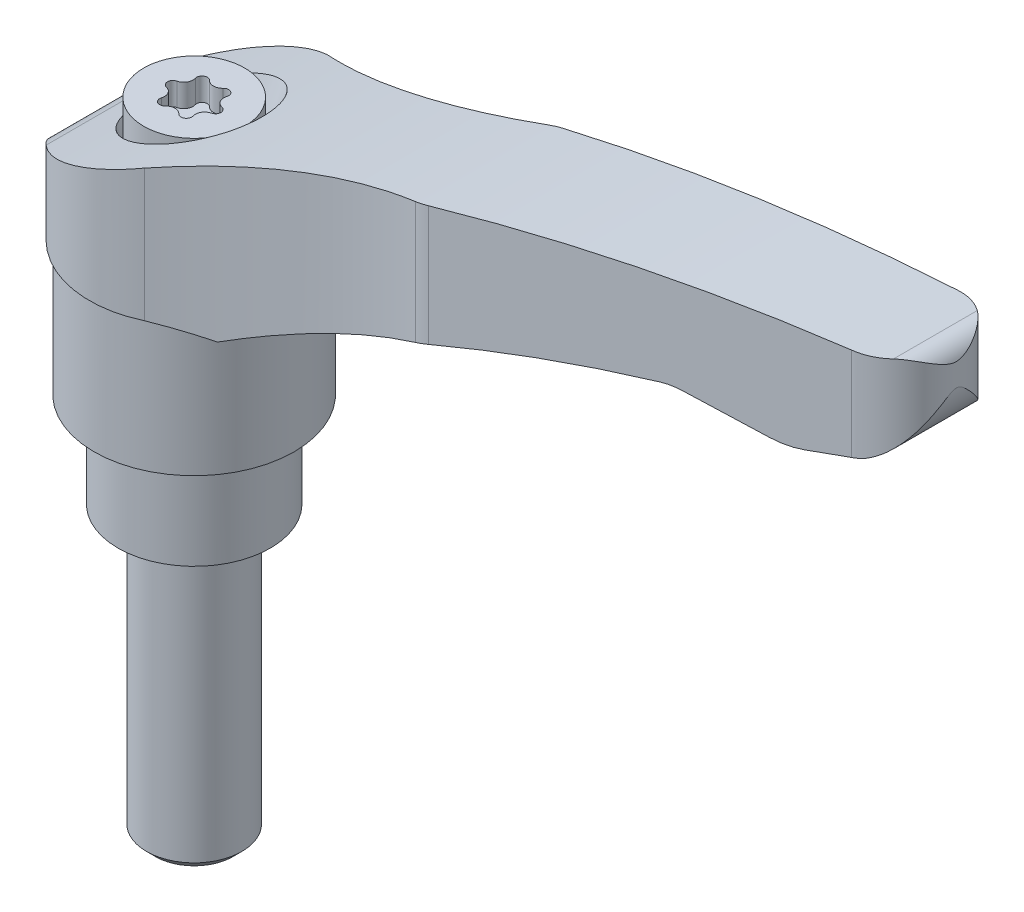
ISO-10303-21;
HEADER;
FILE_DESCRIPTION(('STEP AP214'),'2;1');
FILE_NAME('part.step','',(''),(''),'','','');
FILE_SCHEMA(('AUTOMOTIVE_DESIGN { 1 0 10303 214 1 1 1 1 }'));
ENDSEC;
DATA;
#1=APPLICATION_CONTEXT('core data for automotive mechanical design processes');
#2=APPLICATION_PROTOCOL_DEFINITION('international standard','automotive_design',2000,#1);
#3=PRODUCT_CONTEXT('',#1,'mechanical');
#4=PRODUCT('Part','Part','',(#3));
#5=PRODUCT_RELATED_PRODUCT_CATEGORY('part','',(#4));
#6=PRODUCT_DEFINITION_FORMATION('','',#4);
#7=PRODUCT_DEFINITION_CONTEXT('part definition',#1,'design');
#8=PRODUCT_DEFINITION('design','',#6,#7);
#9=PRODUCT_DEFINITION_SHAPE('','',#8);
#10=(LENGTH_UNIT() NAMED_UNIT(*) SI_UNIT(.MILLI.,.METRE.));
#11=(NAMED_UNIT(*) PLANE_ANGLE_UNIT() SI_UNIT($,.RADIAN.));
#12=(NAMED_UNIT(*) SI_UNIT($,.STERADIAN.) SOLID_ANGLE_UNIT());
#13=UNCERTAINTY_MEASURE_WITH_UNIT(LENGTH_MEASURE(1.E-05),#10,'distance_accuracy_value','');
#14=(GEOMETRIC_REPRESENTATION_CONTEXT(3) GLOBAL_UNCERTAINTY_ASSIGNED_CONTEXT((#13)) GLOBAL_UNIT_ASSIGNED_CONTEXT((#10,
#11,#12)) REPRESENTATION_CONTEXT('',''));
#15=CARTESIAN_POINT('',(0.,0.,0.));
#16=DIRECTION('',(0.,0.,1.));
#17=DIRECTION('',(1.,0.,0.));
#18=AXIS2_PLACEMENT_3D('',#15,#16,#17);
#19=CARTESIAN_POINT('',(0.,39.4,2.99687372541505));
#20=DIRECTION('',(0.,1.,0.));
#21=DIRECTION('',(0.,0.,1.));
#22=AXIS2_PLACEMENT_3D('',#19,#20,#21);
#23=CYLINDRICAL_SURFACE('',#22,0.98);
#24=DIRECTION('',(0.,1.,0.));
#25=VECTOR('',#24,1.);
#26=CARTESIAN_POINT('',(0.712727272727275,39.4,2.32425211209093));
#27=LINE('',#26,#25);
#28=CARTESIAN_POINT('',(0.712727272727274,37.,2.32425211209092));
#29=VERTEX_POINT('',#28);
#30=CARTESIAN_POINT('',(0.712727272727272,34.6,2.32425211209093));
#31=VERTEX_POINT('',#30);
#32=EDGE_CURVE('E176',#29,#31,#27,.F.);
#33=ORIENTED_EDGE('',*,*,#32,.T.);
#34=CARTESIAN_POINT('',(0.,34.6,2.99687372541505));
#35=DIRECTION('',(0.,1.,0.));
#36=DIRECTION('',(0.,0.,1.));
#37=AXIS2_PLACEMENT_3D('',#34,#35,#36);
#38=CIRCLE('',#37,0.98);
#39=CARTESIAN_POINT('',(-0.712727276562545,34.6,2.32425211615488));
#40=VERTEX_POINT('',#39);
#41=EDGE_CURVE('E165',#31,#40,#38,.T.);
#42=ORIENTED_EDGE('',*,*,#41,.T.);
#43=DIRECTION('',(0.,1.,0.));
#44=VECTOR('',#43,1.);
#45=CARTESIAN_POINT('',(-0.712727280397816,39.4,2.32425212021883));
#46=LINE('',#45,#44);
#47=CARTESIAN_POINT('',(-0.712727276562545,37.,2.32425211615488));
#48=VERTEX_POINT('',#47);
#49=EDGE_CURVE('E159',#40,#48,#46,.T.);
#50=ORIENTED_EDGE('',*,*,#49,.T.);
#51=CARTESIAN_POINT('',(0.,37.,2.99687372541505));
#52=DIRECTION('',(0.,1.,0.));
#53=DIRECTION('',(0.,0.,1.));
#54=AXIS2_PLACEMENT_3D('',#51,#52,#53);
#55=CIRCLE('',#54,0.98);
#56=EDGE_CURVE('E19',#48,#29,#55,.F.);
#57=ORIENTED_EDGE('',*,*,#56,.T.);
#58=EDGE_LOOP('',(#33,#42,#50,#57));
#59=FACE_BOUND('',#58,.T.);
#60=ADVANCED_FACE('F16',(#59),#23,.T.);
#61=CARTESIAN_POINT('',(-1.12,39.4,1.93989690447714));
#62=DIRECTION('',(0.,1.,0.));
#63=DIRECTION('',(0.,0.,1.));
#64=AXIS2_PLACEMENT_3D('',#61,#62,#63);
#65=CYLINDRICAL_SURFACE('',#64,0.56);
#66=CARTESIAN_POINT('',(-1.12,34.6,1.93989690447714));
#67=DIRECTION('',(0.,1.,0.));
#68=DIRECTION('',(0.,0.,1.));
#69=AXIS2_PLACEMENT_3D('',#66,#67,#68);
#70=CIRCLE('',#69,0.56);
#71=CARTESIAN_POINT('',(-1.65649773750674,34.6,1.77936598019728));
#72=VERTEX_POINT('',#71);
#73=EDGE_CURVE('E150',#72,#40,#70,.T.);
#74=ORIENTED_EDGE('',*,*,#73,.F.);
#75=DIRECTION('',(0.,1.,0.));
#76=VECTOR('',#75,1.);
#77=CARTESIAN_POINT('',(-1.65649773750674,39.4,1.77936598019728));
#78=LINE('',#77,#76);
#79=CARTESIAN_POINT('',(-1.65649773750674,37.,1.77936598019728));
#80=VERTEX_POINT('',#79);
#81=EDGE_CURVE('E162',#80,#72,#78,.F.);
#82=ORIENTED_EDGE('',*,*,#81,.F.);
#83=CARTESIAN_POINT('',(-1.12,37.,1.93989690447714));
#84=DIRECTION('',(0.,1.,0.));
#85=DIRECTION('',(0.,0.,1.));
#86=AXIS2_PLACEMENT_3D('',#83,#84,#85);
#87=CIRCLE('',#86,0.56);
#88=EDGE_CURVE('E155',#48,#80,#87,.F.);
#89=ORIENTED_EDGE('',*,*,#88,.F.);
#90=ORIENTED_EDGE('',*,*,#49,.F.);
#91=EDGE_LOOP('',(#74,#82,#89,#90));
#92=FACE_BOUND('',#91,.T.);
#93=ADVANCED_FACE('F157',(#92),#65,.F.);
#94=CARTESIAN_POINT('',(-2.59536877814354,39.4,1.49843686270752));
#95=DIRECTION('',(0.,1.,0.));
#96=DIRECTION('',(0.,0.,1.));
#97=AXIS2_PLACEMENT_3D('',#94,#95,#96);
#98=CYLINDRICAL_SURFACE('',#97,0.979999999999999);
#99=ORIENTED_EDGE('',*,*,#81,.T.);
#100=CARTESIAN_POINT('',(-2.59536877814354,34.6,1.49843686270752));
#101=DIRECTION('',(0.,1.,0.));
#102=DIRECTION('',(0.,0.,1.));
#103=AXIS2_PLACEMENT_3D('',#100,#101,#102);
#104=CIRCLE('',#103,0.979999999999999);
#105=CARTESIAN_POINT('',(-2.36922501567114,34.6,0.544886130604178));
#106=VERTEX_POINT('',#105);
#107=EDGE_CURVE('E373',#72,#106,#104,.T.);
#108=ORIENTED_EDGE('',*,*,#107,.T.);
#109=DIRECTION('',(0.,1.,0.));
#110=VECTOR('',#109,1.);
#111=CARTESIAN_POINT('',(-2.36922502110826,39.4,0.544886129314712));
#112=LINE('',#111,#110);
#113=CARTESIAN_POINT('',(-2.36922501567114,37.,0.544886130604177));
#114=VERTEX_POINT('',#113);
#115=EDGE_CURVE('E367',#106,#114,#112,.T.);
#116=ORIENTED_EDGE('',*,*,#115,.T.);
#117=CARTESIAN_POINT('',(-2.59536877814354,37.,1.49843686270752));
#118=DIRECTION('',(0.,1.,0.));
#119=DIRECTION('',(0.,0.,1.));
#120=AXIS2_PLACEMENT_3D('',#117,#118,#119);
#121=CIRCLE('',#120,0.979999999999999);
#122=EDGE_CURVE('E376',#114,#80,#121,.F.);
#123=ORIENTED_EDGE('',*,*,#122,.T.);
#124=EDGE_LOOP('',(#99,#108,#116,#123));
#125=FACE_BOUND('',#124,.T.);
#126=ADVANCED_FACE('F515',(#125),#98,.T.);
#127=CARTESIAN_POINT('',(1.12,39.4,1.93989690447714));
#128=DIRECTION('',(0.,1.,0.));
#129=DIRECTION('',(0.,0.,1.));
#130=AXIS2_PLACEMENT_3D('',#127,#128,#129);
#131=CYLINDRICAL_SURFACE('',#130,0.56);
#132=CARTESIAN_POINT('',(1.12,34.6,1.93989690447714));
#133=DIRECTION('',(0.,1.,0.));
#134=DIRECTION('',(0.,0.,1.));
#135=AXIS2_PLACEMENT_3D('',#132,#133,#134);
#136=CIRCLE('',#135,0.56);
#137=CARTESIAN_POINT('',(1.65649773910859,34.6,1.7793659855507));
#138=VERTEX_POINT('',#137);
#139=EDGE_CURVE('E370',#31,#138,#136,.T.);
#140=ORIENTED_EDGE('',*,*,#139,.F.);
#141=ORIENTED_EDGE('',*,*,#32,.F.);
#142=CARTESIAN_POINT('',(1.12,37.,1.93989690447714));
#143=DIRECTION('',(0.,1.,0.));
#144=DIRECTION('',(0.,0.,1.));
#145=AXIS2_PLACEMENT_3D('',#142,#143,#144);
#146=CIRCLE('',#145,0.56);
#147=CARTESIAN_POINT('',(1.65649773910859,37.,1.7793659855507));
#148=VERTEX_POINT('',#147);
#149=EDGE_CURVE('E170',#148,#29,#146,.F.);
#150=ORIENTED_EDGE('',*,*,#149,.F.);
#151=DIRECTION('',(0.,1.,0.));
#152=VECTOR('',#151,1.);
#153=CARTESIAN_POINT('',(1.65649774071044,39.4,1.77936599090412));
#154=LINE('',#153,#152);
#155=EDGE_CURVE('E364',#138,#148,#154,.T.);
#156=ORIENTED_EDGE('',*,*,#155,.F.);
#157=EDGE_LOOP('',(#140,#141,#150,#156));
#158=FACE_BOUND('',#157,.T.);
#159=ADVANCED_FACE('F379',(#158),#131,.F.);
#160=CARTESIAN_POINT('',(-2.24,39.4,0.));
#161=DIRECTION('',(0.,1.,0.));
#162=DIRECTION('',(0.,0.,1.));
#163=AXIS2_PLACEMENT_3D('',#160,#161,#162);
#164=CYLINDRICAL_SURFACE('',#163,0.56);
#165=CARTESIAN_POINT('',(-2.24,34.6,0.));
#166=DIRECTION('',(0.,1.,0.));
#167=DIRECTION('',(0.,0.,1.));
#168=AXIS2_PLACEMENT_3D('',#165,#166,#167);
#169=CIRCLE('',#168,0.56);
#170=CARTESIAN_POINT('',(-2.36922501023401,34.6,-0.544886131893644));
#171=VERTEX_POINT('',#170);
#172=EDGE_CURVE('E365',#171,#106,#169,.T.);
#173=ORIENTED_EDGE('',*,*,#172,.F.);
#174=DIRECTION('',(0.,1.,0.));
#175=VECTOR('',#174,1.);
#176=CARTESIAN_POINT('',(-2.36922501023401,39.4,-0.544886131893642));
#177=LINE('',#176,#175);
#178=CARTESIAN_POINT('',(-2.36922501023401,37.,-0.544886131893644));
#179=VERTEX_POINT('',#178);
#180=EDGE_CURVE('E354',#179,#171,#177,.F.);
#181=ORIENTED_EDGE('',*,*,#180,.F.);
#182=CARTESIAN_POINT('',(-2.24,37.,0.));
#183=DIRECTION('',(0.,1.,0.));
#184=DIRECTION('',(0.,0.,1.));
#185=AXIS2_PLACEMENT_3D('',#182,#183,#184);
#186=CIRCLE('',#185,0.56);
#187=EDGE_CURVE('E368',#114,#179,#186,.F.);
#188=ORIENTED_EDGE('',*,*,#187,.F.);
#189=ORIENTED_EDGE('',*,*,#115,.F.);
#190=EDGE_LOOP('',(#173,#181,#188,#189));
#191=FACE_BOUND('',#190,.T.);
#192=ADVANCED_FACE('F520',(#191),#164,.F.);
#193=CARTESIAN_POINT('',(2.59536877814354,39.4,1.49843686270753));
#194=DIRECTION('',(0.,1.,0.));
#195=DIRECTION('',(0.,0.,1.));
#196=AXIS2_PLACEMENT_3D('',#193,#194,#195);
#197=CYLINDRICAL_SURFACE('',#196,0.980000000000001);
#198=DIRECTION('',(0.,1.,0.));
#199=VECTOR('',#198,1.);
#200=CARTESIAN_POINT('',(2.36922500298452,39.4,0.544886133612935));
#201=LINE('',#200,#199);
#202=CARTESIAN_POINT('',(2.36922500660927,37.,0.544886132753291));
#203=VERTEX_POINT('',#202);
#204=CARTESIAN_POINT('',(2.36922500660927,34.6,0.544886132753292));
#205=VERTEX_POINT('',#204);
#206=EDGE_CURVE('E348',#203,#205,#201,.F.);
#207=ORIENTED_EDGE('',*,*,#206,.T.);
#208=CARTESIAN_POINT('',(2.59536877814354,34.6,1.49843686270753));
#209=DIRECTION('',(0.,1.,0.));
#210=DIRECTION('',(0.,0.,1.));
#211=AXIS2_PLACEMENT_3D('',#208,#209,#210);
#212=CIRCLE('',#211,0.980000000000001);
#213=EDGE_CURVE('E358',#205,#138,#212,.T.);
#214=ORIENTED_EDGE('',*,*,#213,.T.);
#215=ORIENTED_EDGE('',*,*,#155,.T.);
#216=CARTESIAN_POINT('',(2.59536877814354,37.,1.49843686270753));
#217=DIRECTION('',(0.,1.,0.));
#218=DIRECTION('',(0.,0.,1.));
#219=AXIS2_PLACEMENT_3D('',#216,#217,#218);
#220=CIRCLE('',#219,0.980000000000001);
#221=EDGE_CURVE('E361',#148,#203,#220,.F.);
#222=ORIENTED_EDGE('',*,*,#221,.T.);
#223=EDGE_LOOP('',(#207,#214,#215,#222));
#224=FACE_BOUND('',#223,.T.);
#225=ADVANCED_FACE('F541',(#224),#197,.T.);
#226=CARTESIAN_POINT('',(-2.59536877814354,39.4,-1.49843686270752));
#227=DIRECTION('',(0.,1.,0.));
#228=DIRECTION('',(0.,0.,1.));
#229=AXIS2_PLACEMENT_3D('',#226,#227,#228);
#230=CYLINDRICAL_SURFACE('',#229,0.98);
#231=ORIENTED_EDGE('',*,*,#180,.T.);
#232=CARTESIAN_POINT('',(-2.59536877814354,34.6,-1.49843686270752));
#233=DIRECTION('',(0.,1.,0.));
#234=DIRECTION('',(0.,0.,1.));
#235=AXIS2_PLACEMENT_3D('',#232,#233,#234);
#236=CIRCLE('',#235,0.98);
#237=CARTESIAN_POINT('',(-1.65649773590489,34.6,-1.77936597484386));
#238=VERTEX_POINT('',#237);
#239=EDGE_CURVE('E351',#171,#238,#236,.T.);
#240=ORIENTED_EDGE('',*,*,#239,.T.);
#241=DIRECTION('',(0.,1.,0.));
#242=VECTOR('',#241,1.);
#243=CARTESIAN_POINT('',(-1.65649773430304,39.4,-1.77936596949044));
#244=LINE('',#243,#242);
#245=CARTESIAN_POINT('',(-1.65649773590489,37.,-1.77936597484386));
#246=VERTEX_POINT('',#245);
#247=EDGE_CURVE('E342',#238,#246,#244,.T.);
#248=ORIENTED_EDGE('',*,*,#247,.T.);
#249=CARTESIAN_POINT('',(-2.59536877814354,37.,-1.49843686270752));
#250=DIRECTION('',(0.,1.,0.));
#251=DIRECTION('',(0.,0.,1.));
#252=AXIS2_PLACEMENT_3D('',#249,#250,#251);
#253=CIRCLE('',#252,0.98);
#254=EDGE_CURVE('E355',#246,#179,#253,.F.);
#255=ORIENTED_EDGE('',*,*,#254,.T.);
#256=EDGE_LOOP('',(#231,#240,#248,#255));
#257=FACE_BOUND('',#256,.T.);
#258=ADVANCED_FACE('F523',(#257),#230,.T.);
#259=CARTESIAN_POINT('',(2.24,39.4,0.));
#260=DIRECTION('',(0.,1.,0.));
#261=DIRECTION('',(0.,0.,1.));
#262=AXIS2_PLACEMENT_3D('',#259,#260,#261);
#263=CYLINDRICAL_SURFACE('',#262,0.56);
#264=CARTESIAN_POINT('',(2.24,34.6,0.));
#265=DIRECTION('',(0.,1.,0.));
#266=DIRECTION('',(0.,0.,1.));
#267=AXIS2_PLACEMENT_3D('',#264,#265,#266);
#268=CIRCLE('',#267,0.56);
#269=CARTESIAN_POINT('',(2.36922501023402,34.6,-0.544886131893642));
#270=VERTEX_POINT('',#269);
#271=EDGE_CURVE('E346',#205,#270,#268,.T.);
#272=ORIENTED_EDGE('',*,*,#271,.F.);
#273=ORIENTED_EDGE('',*,*,#206,.F.);
#274=CARTESIAN_POINT('',(2.24,37.,0.));
#275=DIRECTION('',(0.,1.,0.));
#276=DIRECTION('',(0.,0.,1.));
#277=AXIS2_PLACEMENT_3D('',#274,#275,#276);
#278=CIRCLE('',#277,0.56);
#279=CARTESIAN_POINT('',(2.36922501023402,37.,-0.544886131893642));
#280=VERTEX_POINT('',#279);
#281=EDGE_CURVE('E349',#280,#203,#278,.F.);
#282=ORIENTED_EDGE('',*,*,#281,.F.);
#283=DIRECTION('',(0.,1.,0.));
#284=VECTOR('',#283,1.);
#285=CARTESIAN_POINT('',(2.36922501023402,39.4,-0.544886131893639));
#286=LINE('',#285,#284);
#287=EDGE_CURVE('E339',#270,#280,#286,.T.);
#288=ORIENTED_EDGE('',*,*,#287,.F.);
#289=EDGE_LOOP('',(#272,#273,#282,#288));
#290=FACE_BOUND('',#289,.T.);
#291=ADVANCED_FACE('F543',(#290),#263,.F.);
#292=CARTESIAN_POINT('',(4.08,-30.,0.));
#293=DIRECTION('',(0.,1.,0.));
#294=DIRECTION('',(0.,0.,1.));
#295=AXIS2_PLACEMENT_3D('',#292,#293,#294);
#296=PLANE('',#295);
#297=CARTESIAN_POINT('',(0.,-29.9999999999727,0.));
#298=DIRECTION('',(0.,1.,0.));
#299=DIRECTION('',(-1.,0.,0.));
#300=AXIS2_PLACEMENT_3D('',#297,#298,#299);
#301=CIRCLE('',#300,4.07999999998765);
#302=CARTESIAN_POINT('',(-4.07999999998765,-29.9999999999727,0.));
#303=VERTEX_POINT('',#302);
#304=EDGE_CURVE('E333',#303,#303,#301,.T.);
#305=ORIENTED_EDGE('',*,*,#304,.F.);
#306=EDGE_LOOP('',(#305));
#307=FACE_BOUND('',#306,.T.);
#308=ADVANCED_FACE('F545',(#307),#296,.F.);
#309=CARTESIAN_POINT('',(-1.12,39.4,-1.93989690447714));
#310=DIRECTION('',(0.,1.,0.));
#311=DIRECTION('',(0.,0.,1.));
#312=AXIS2_PLACEMENT_3D('',#309,#310,#311);
#313=CYLINDRICAL_SURFACE('',#312,0.56);
#314=CARTESIAN_POINT('',(-1.12,34.6,-1.93989690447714));
#315=DIRECTION('',(0.,1.,0.));
#316=DIRECTION('',(0.,0.,1.));
#317=AXIS2_PLACEMENT_3D('',#314,#315,#316);
#318=CIRCLE('',#317,0.56);
#319=CARTESIAN_POINT('',(-0.712727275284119,34.6,-2.32425211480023));
#320=VERTEX_POINT('',#319);
#321=EDGE_CURVE('E340',#320,#238,#318,.T.);
#322=ORIENTED_EDGE('',*,*,#321,.F.);
#323=DIRECTION('',(0.,1.,0.));
#324=VECTOR('',#323,1.);
#325=CARTESIAN_POINT('',(-0.712727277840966,39.4,-2.32425211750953));
#326=LINE('',#325,#324);
#327=CARTESIAN_POINT('',(-0.712727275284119,37.,-2.32425211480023));
#328=VERTEX_POINT('',#327);
#329=EDGE_CURVE('E332',#328,#320,#326,.F.);
#330=ORIENTED_EDGE('',*,*,#329,.F.);
#331=CARTESIAN_POINT('',(-1.12,37.,-1.93989690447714));
#332=DIRECTION('',(0.,1.,0.));
#333=DIRECTION('',(0.,0.,1.));
#334=AXIS2_PLACEMENT_3D('',#331,#332,#333);
#335=CIRCLE('',#334,0.56);
#336=EDGE_CURVE('E343',#246,#328,#335,.F.);
#337=ORIENTED_EDGE('',*,*,#336,.F.);
#338=ORIENTED_EDGE('',*,*,#247,.F.);
#339=EDGE_LOOP('',(#322,#330,#337,#338));
#340=FACE_BOUND('',#339,.T.);
#341=ADVANCED_FACE('F529',(#340),#313,.F.);
#342=CARTESIAN_POINT('',(2.59536877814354,39.4,-1.49843686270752));
#343=DIRECTION('',(0.,1.,0.));
#344=DIRECTION('',(0.,0.,1.));
#345=AXIS2_PLACEMENT_3D('',#342,#343,#344);
#346=CYLINDRICAL_SURFACE('',#345,0.980000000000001);
#347=DIRECTION('',(0.,1.,0.));
#348=VECTOR('',#347,1.);
#349=CARTESIAN_POINT('',(1.65649773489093,39.4,-1.77936597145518));
#350=LINE('',#349,#348);
#351=CARTESIAN_POINT('',(1.65649773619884,37.,-1.77936597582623));
#352=VERTEX_POINT('',#351);
#353=CARTESIAN_POINT('',(1.65649773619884,34.6,-1.77936597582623));
#354=VERTEX_POINT('',#353);
#355=EDGE_CURVE('E326',#352,#354,#350,.F.);
#356=ORIENTED_EDGE('',*,*,#355,.T.);
#357=CARTESIAN_POINT('',(2.59536877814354,34.6,-1.49843686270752));
#358=DIRECTION('',(0.,1.,0.));
#359=DIRECTION('',(0.,0.,1.));
#360=AXIS2_PLACEMENT_3D('',#357,#358,#359);
#361=CIRCLE('',#360,0.980000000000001);
#362=EDGE_CURVE('E329',#270,#354,#361,.F.);
#363=ORIENTED_EDGE('',*,*,#362,.F.);
#364=ORIENTED_EDGE('',*,*,#287,.T.);
#365=CARTESIAN_POINT('',(2.59536877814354,37.,-1.49843686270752));
#366=DIRECTION('',(0.,1.,0.));
#367=DIRECTION('',(0.,0.,1.));
#368=AXIS2_PLACEMENT_3D('',#365,#366,#367);
#369=CIRCLE('',#368,0.980000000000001);
#370=EDGE_CURVE('E336',#280,#352,#369,.F.);
#371=ORIENTED_EDGE('',*,*,#370,.T.);
#372=EDGE_LOOP('',(#356,#363,#364,#371));
#373=FACE_BOUND('',#372,.T.);
#374=ADVANCED_FACE('F397',(#373),#346,.T.);
#375=CARTESIAN_POINT('',(0.,-29.0800000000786,0.));
#376=DIRECTION('',(0.,1.,0.));
#377=DIRECTION('',(-1.,0.,0.));
#378=AXIS2_PLACEMENT_3D('',#375,#376,#377);
#379=CONICAL_SURFACE('',#378,4.99999999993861,0.785398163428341);
#380=CARTESIAN_POINT('',(0.,-29.08,0.));
#381=DIRECTION('',(0.,1.,0.));
#382=DIRECTION('',(0.,0.,1.));
#383=AXIS2_PLACEMENT_3D('',#380,#381,#382);
#384=CIRCLE('',#383,5.);
#385=CARTESIAN_POINT('',(0.,-29.08,5.));
#386=VERTEX_POINT('',#385);
#387=EDGE_CURVE('E323',#386,#386,#384,.T.);
#388=ORIENTED_EDGE('',*,*,#387,.F.);
#389=EDGE_LOOP('',(#388));
#390=FACE_BOUND('',#389,.T.);
#391=ORIENTED_EDGE('',*,*,#304,.T.);
#392=EDGE_LOOP('',(#391));
#393=FACE_BOUND('',#392,.T.);
#394=ADVANCED_FACE('F387',(#390,#393),#379,.T.);
#395=CARTESIAN_POINT('',(-1.85768438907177,34.6,-1.71916688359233));
#396=DIRECTION('',(0.,1.,0.));
#397=DIRECTION('',(0.,0.,1.));
#398=AXIS2_PLACEMENT_3D('',#395,#396,#397);
#399=PLANE('',#398);
#400=ORIENTED_EDGE('',*,*,#362,.T.);
#401=CARTESIAN_POINT('',(1.12,34.6,-1.93989690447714));
#402=DIRECTION('',(0.,1.,0.));
#403=DIRECTION('',(0.,0.,1.));
#404=AXIS2_PLACEMENT_3D('',#401,#402,#403);
#405=CIRCLE('',#404,0.56);
#406=CARTESIAN_POINT('',(0.712727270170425,34.6,-2.32425210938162));
#407=VERTEX_POINT('',#406);
#408=EDGE_CURVE('E324',#354,#407,#405,.T.);
#409=ORIENTED_EDGE('',*,*,#408,.T.);
#410=CARTESIAN_POINT('',(0.,34.6,-2.99687372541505));
#411=DIRECTION('',(0.,1.,0.));
#412=DIRECTION('',(0.,0.,1.));
#413=AXIS2_PLACEMENT_3D('',#410,#411,#412);
#414=CIRCLE('',#413,0.98);
#415=EDGE_CURVE('E320',#320,#407,#414,.T.);
#416=ORIENTED_EDGE('',*,*,#415,.F.);
#417=ORIENTED_EDGE('',*,*,#321,.T.);
#418=ORIENTED_EDGE('',*,*,#239,.F.);
#419=ORIENTED_EDGE('',*,*,#172,.T.);
#420=ORIENTED_EDGE('',*,*,#107,.F.);
#421=ORIENTED_EDGE('',*,*,#73,.T.);
#422=ORIENTED_EDGE('',*,*,#41,.F.);
#423=ORIENTED_EDGE('',*,*,#139,.T.);
#424=ORIENTED_EDGE('',*,*,#213,.F.);
#425=ORIENTED_EDGE('',*,*,#271,.T.);
#426=EDGE_LOOP('',(#400,#409,#416,#417,#418,#419,#420,#421,#422,#423,#424,#425));
#427=FACE_BOUND('',#426,.T.);
#428=ADVANCED_FACE('F382',(#427),#399,.T.);
#429=CARTESIAN_POINT('',(1.12,39.4,-1.93989690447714));
#430=DIRECTION('',(0.,1.,0.));
#431=DIRECTION('',(0.,0.,1.));
#432=AXIS2_PLACEMENT_3D('',#429,#430,#431);
#433=CYLINDRICAL_SURFACE('',#432,0.56);
#434=ORIENTED_EDGE('',*,*,#408,.F.);
#435=ORIENTED_EDGE('',*,*,#355,.F.);
#436=CARTESIAN_POINT('',(1.12,37.,-1.93989690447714));
#437=DIRECTION('',(0.,1.,0.));
#438=DIRECTION('',(0.,0.,1.));
#439=AXIS2_PLACEMENT_3D('',#436,#437,#438);
#440=CIRCLE('',#439,0.56);
#441=CARTESIAN_POINT('',(0.712727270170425,37.,-2.32425210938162));
#442=VERTEX_POINT('',#441);
#443=EDGE_CURVE('E327',#442,#352,#440,.F.);
#444=ORIENTED_EDGE('',*,*,#443,.F.);
#445=DIRECTION('',(0.,1.,0.));
#446=VECTOR('',#445,1.);
#447=CARTESIAN_POINT('',(0.712727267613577,39.4,-2.32425210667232));
#448=LINE('',#447,#446);
#449=EDGE_CURVE('E319',#407,#442,#448,.T.);
#450=ORIENTED_EDGE('',*,*,#449,.F.);
#451=EDGE_LOOP('',(#434,#435,#444,#450));
#452=FACE_BOUND('',#451,.T.);
#453=ADVANCED_FACE('F386',(#452),#433,.F.);
#454=CARTESIAN_POINT('',(0.,-30.,0.));
#455=DIRECTION('',(0.,1.,0.));
#456=DIRECTION('',(0.,0.,1.));
#457=AXIS2_PLACEMENT_3D('',#454,#455,#456);
#458=CYLINDRICAL_SURFACE('',#457,5.);
#459=ORIENTED_EDGE('',*,*,#387,.T.);
#460=EDGE_LOOP('',(#459));
#461=FACE_BOUND('',#460,.T.);
#462=CARTESIAN_POINT('',(0.,0.,0.));
#463=DIRECTION('',(0.,1.,0.));
#464=DIRECTION('',(0.,0.,1.));
#465=AXIS2_PLACEMENT_3D('',#462,#463,#464);
#466=CIRCLE('',#465,5.);
#467=CARTESIAN_POINT('',(0.,0.,5.));
#468=VERTEX_POINT('',#467);
#469=EDGE_CURVE('E316',#468,#468,#466,.F.);
#470=ORIENTED_EDGE('',*,*,#469,.T.);
#471=EDGE_LOOP('',(#470));
#472=FACE_BOUND('',#471,.T.);
#473=ADVANCED_FACE('F394',(#461,#472),#458,.T.);
#474=CARTESIAN_POINT('',(0.,39.4,-2.99687372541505));
#475=DIRECTION('',(0.,1.,0.));
#476=DIRECTION('',(0.,0.,1.));
#477=AXIS2_PLACEMENT_3D('',#474,#475,#476);
#478=CYLINDRICAL_SURFACE('',#477,0.98);
#479=ORIENTED_EDGE('',*,*,#449,.T.);
#480=CARTESIAN_POINT('',(0.,37.,-2.99687372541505));
#481=DIRECTION('',(0.,1.,0.));
#482=DIRECTION('',(0.,0.,1.));
#483=AXIS2_PLACEMENT_3D('',#480,#481,#482);
#484=CIRCLE('',#483,0.98);
#485=EDGE_CURVE('E314',#442,#328,#484,.F.);
#486=ORIENTED_EDGE('',*,*,#485,.T.);
#487=ORIENTED_EDGE('',*,*,#329,.T.);
#488=ORIENTED_EDGE('',*,*,#415,.T.);
#489=EDGE_LOOP('',(#479,#486,#487,#488));
#490=FACE_BOUND('',#489,.T.);
#491=ADVANCED_FACE('F533',(#490),#478,.T.);
#492=CARTESIAN_POINT('',(8.,0.,0.));
#493=DIRECTION('',(0.,1.,0.));
#494=DIRECTION('',(0.,0.,1.));
#495=AXIS2_PLACEMENT_3D('',#492,#493,#494);
#496=PLANE('',#495);
#497=ORIENTED_EDGE('',*,*,#469,.F.);
#498=EDGE_LOOP('',(#497));
#499=FACE_BOUND('',#498,.T.);
#500=CARTESIAN_POINT('',(0.,0.,0.));
#501=DIRECTION('',(0.,1.,0.));
#502=DIRECTION('',(0.,0.,1.));
#503=AXIS2_PLACEMENT_3D('',#500,#501,#502);
#504=CIRCLE('',#503,8.);
#505=CARTESIAN_POINT('',(0.,0.,8.));
#506=VERTEX_POINT('',#505);
#507=EDGE_CURVE('E311',#506,#506,#504,.T.);
#508=ORIENTED_EDGE('',*,*,#507,.F.);
#509=EDGE_LOOP('',(#508));
#510=FACE_BOUND('',#509,.T.);
#511=ADVANCED_FACE('F672',(#499,#510),#496,.F.);
#512=CARTESIAN_POINT('',(0.,37.,0.));
#513=DIRECTION('',(0.,-1.,0.));
#514=DIRECTION('',(0.,0.,-1.));
#515=AXIS2_PLACEMENT_3D('',#512,#513,#514);
#516=PLANE('',#515);
#517=CARTESIAN_POINT('',(0.,37.,0.));
#518=DIRECTION('',(0.,1.,0.));
#519=DIRECTION('',(0.,0.,1.));
#520=AXIS2_PLACEMENT_3D('',#517,#518,#519);
#521=CIRCLE('',#520,5.3);
#522=CARTESIAN_POINT('',(0.,37.,5.3));
#523=VERTEX_POINT('',#522);
#524=EDGE_CURVE('E308',#523,#523,#521,.F.);
#525=ORIENTED_EDGE('',*,*,#524,.F.);
#526=EDGE_LOOP('',(#525));
#527=FACE_BOUND('',#526,.T.);
#528=ORIENTED_EDGE('',*,*,#443,.T.);
#529=ORIENTED_EDGE('',*,*,#370,.F.);
#530=ORIENTED_EDGE('',*,*,#281,.T.);
#531=ORIENTED_EDGE('',*,*,#221,.F.);
#532=ORIENTED_EDGE('',*,*,#149,.T.);
#533=ORIENTED_EDGE('',*,*,#56,.F.);
#534=ORIENTED_EDGE('',*,*,#88,.T.);
#535=ORIENTED_EDGE('',*,*,#122,.F.);
#536=ORIENTED_EDGE('',*,*,#187,.T.);
#537=ORIENTED_EDGE('',*,*,#254,.F.);
#538=ORIENTED_EDGE('',*,*,#336,.T.);
#539=ORIENTED_EDGE('',*,*,#485,.F.);
#540=EDGE_LOOP('',(#528,#529,#530,#531,#532,#533,#534,#535,#536,#537,#538,#539));
#541=FACE_BOUND('',#540,.T.);
#542=ADVANCED_FACE('F168',(#527,#541),#516,.F.);
#543=CARTESIAN_POINT('',(0.,-30.,0.));
#544=DIRECTION('',(0.,1.,0.));
#545=DIRECTION('',(0.,0.,1.));
#546=AXIS2_PLACEMENT_3D('',#543,#544,#545);
#547=CYLINDRICAL_SURFACE('',#546,8.);
#548=ORIENTED_EDGE('',*,*,#507,.T.);
#549=EDGE_LOOP('',(#548));
#550=FACE_BOUND('',#549,.T.);
#551=CARTESIAN_POINT('',(0.,10.7,0.));
#552=DIRECTION('',(0.,-1.,0.));
#553=DIRECTION('',(1.,0.,0.));
#554=AXIS2_PLACEMENT_3D('',#551,#552,#553);
#555=CIRCLE('',#554,8.);
#556=CARTESIAN_POINT('',(8.,10.7,0.));
#557=VERTEX_POINT('',#556);
#558=EDGE_CURVE('E307',#557,#557,#555,.T.);
#559=ORIENTED_EDGE('',*,*,#558,.T.);
#560=EDGE_LOOP('',(#559));
#561=FACE_BOUND('',#560,.T.);
#562=ADVANCED_FACE('F690',(#550,#561),#547,.T.);
#563=CARTESIAN_POINT('',(0.,-30.,0.));
#564=DIRECTION('',(0.,1.,0.));
#565=DIRECTION('',(0.,0.,1.));
#566=AXIS2_PLACEMENT_3D('',#563,#564,#565);
#567=CYLINDRICAL_SURFACE('',#566,5.3);
#568=ORIENTED_EDGE('',*,*,#524,.T.);
#569=EDGE_LOOP('',(#568));
#570=FACE_BOUND('',#569,.T.);
#571=CARTESIAN_POINT('',(0.,33.4,0.));
#572=DIRECTION('',(0.,1.,0.));
#573=DIRECTION('',(0.,0.,1.));
#574=AXIS2_PLACEMENT_3D('',#571,#572,#573);
#575=CIRCLE('',#574,5.3);
#576=CARTESIAN_POINT('',(0.,33.4,5.3));
#577=VERTEX_POINT('',#576);
#578=EDGE_CURVE('E304',#577,#577,#575,.T.);
#579=ORIENTED_EDGE('',*,*,#578,.T.);
#580=EDGE_LOOP('',(#579));
#581=FACE_BOUND('',#580,.T.);
#582=ADVANCED_FACE('F700',(#570,#581),#567,.T.);
#583=CARTESIAN_POINT('',(0.,10.4,0.));
#584=DIRECTION('',(0.,-1.,0.));
#585=DIRECTION('',(1.,0.,0.));
#586=AXIS2_PLACEMENT_3D('',#583,#584,#585);
#587=CONICAL_SURFACE('',#586,8.3,0.78539816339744);
#588=CARTESIAN_POINT('',(0.,10.4,0.));
#589=DIRECTION('',(0.,1.,0.));
#590=DIRECTION('',(0.,0.,1.));
#591=AXIS2_PLACEMENT_3D('',#588,#589,#590);
#592=CIRCLE('',#591,8.3);
#593=CARTESIAN_POINT('',(0.,10.4,8.3));
#594=VERTEX_POINT('',#593);
#595=EDGE_CURVE('E303',#594,#594,#592,.F.);
#596=ORIENTED_EDGE('',*,*,#595,.T.);
#597=EDGE_LOOP('',(#596));
#598=FACE_BOUND('',#597,.T.);
#599=ORIENTED_EDGE('',*,*,#558,.F.);
#600=EDGE_LOOP('',(#599));
#601=FACE_BOUND('',#600,.T.);
#602=ADVANCED_FACE('F710',(#598,#601),#587,.F.);
#603=CARTESIAN_POINT('',(5.3,33.4,0.));
#604=DIRECTION('',(0.,1.,0.));
#605=DIRECTION('',(0.,0.,1.));
#606=AXIS2_PLACEMENT_3D('',#603,#604,#605);
#607=PLANE('',#606);
#608=CARTESIAN_POINT('',(0.,33.4,0.));
#609=DIRECTION('',(0.,1.,0.));
#610=DIRECTION('',(0.,0.,1.));
#611=AXIS2_PLACEMENT_3D('',#608,#609,#610);
#612=CIRCLE('',#611,3.5);
#613=CARTESIAN_POINT('',(0.,33.4,3.5));
#614=VERTEX_POINT('',#613);
#615=EDGE_CURVE('E300',#614,#614,#612,.F.);
#616=ORIENTED_EDGE('',*,*,#615,.F.);
#617=EDGE_LOOP('',(#616));
#618=FACE_BOUND('',#617,.T.);
#619=ORIENTED_EDGE('',*,*,#578,.F.);
#620=EDGE_LOOP('',(#619));
#621=FACE_BOUND('',#620,.T.);
#622=ADVANCED_FACE('F720',(#618,#621),#607,.F.);
#623=CARTESIAN_POINT('',(0.,10.,0.));
#624=DIRECTION('',(0.,1.,0.));
#625=DIRECTION('',(0.,0.,1.));
#626=AXIS2_PLACEMENT_3D('',#623,#624,#625);
#627=CYLINDRICAL_SURFACE('',#626,8.3);
#628=ORIENTED_EDGE('',*,*,#595,.F.);
#629=EDGE_LOOP('',(#628));
#630=FACE_BOUND('',#629,.T.);
#631=CARTESIAN_POINT('',(0.,10.,0.));
#632=DIRECTION('',(0.,1.,0.));
#633=DIRECTION('',(0.,0.,1.));
#634=AXIS2_PLACEMENT_3D('',#631,#632,#633);
#635=CIRCLE('',#634,8.3);
#636=CARTESIAN_POINT('',(0.,10.,8.3));
#637=VERTEX_POINT('',#636);
#638=EDGE_CURVE('E297',#637,#637,#635,.F.);
#639=ORIENTED_EDGE('',*,*,#638,.T.);
#640=EDGE_LOOP('',(#639));
#641=FACE_BOUND('',#640,.T.);
#642=ADVANCED_FACE('F730',(#630,#641),#627,.F.);
#643=CARTESIAN_POINT('',(0.,-30.,0.));
#644=DIRECTION('',(0.,1.,0.));
#645=DIRECTION('',(0.,0.,1.));
#646=AXIS2_PLACEMENT_3D('',#643,#644,#645);
#647=CYLINDRICAL_SURFACE('',#646,3.5);
#648=ORIENTED_EDGE('',*,*,#615,.T.);
#649=EDGE_LOOP('',(#648));
#650=FACE_BOUND('',#649,.T.);
#651=CARTESIAN_POINT('',(0.,26.5,0.));
#652=DIRECTION('',(0.,1.,0.));
#653=DIRECTION('',(0.,0.,1.));
#654=AXIS2_PLACEMENT_3D('',#651,#652,#653);
#655=CIRCLE('',#654,3.5);
#656=CARTESIAN_POINT('',(0.,26.5,3.5));
#657=VERTEX_POINT('',#656);
#658=EDGE_CURVE('E293',#657,#657,#655,.F.);
#659=ORIENTED_EDGE('',*,*,#658,.F.);
#660=EDGE_LOOP('',(#659));
#661=FACE_BOUND('',#660,.T.);
#662=ADVANCED_FACE('F740',(#650,#661),#647,.T.);
#663=CARTESIAN_POINT('',(-10.51,10.2499622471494,22.));
#664=DIRECTION('',(0.707106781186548,0.707106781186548,0.));
#665=DIRECTION('',(-0.707106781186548,0.707106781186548,0.));
#666=AXIS2_PLACEMENT_3D('',#663,#664,#665);
#667=PLANE('',#666);
#668=CARTESIAN_POINT('',(-0.0099999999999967,-0.250037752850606,0.));
#669=DIRECTION('',(0.707106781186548,0.707106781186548,0.));
#670=DIRECTION('',(0.707106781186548,-0.707106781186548,0.));
#671=AXIS2_PLACEMENT_3D('',#668,#669,#670);
#672=ELLIPSE('',#671,14.8492424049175,10.5);
#673=CARTESIAN_POINT('',(-10.2600377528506,10.,-2.27743848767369));
#674=VERTEX_POINT('',#673);
#675=CARTESIAN_POINT('',(-10.2600377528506,10.,2.27743848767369));
#676=VERTEX_POINT('',#675);
#677=EDGE_CURVE('E290',#674,#676,#672,.T.);
#678=ORIENTED_EDGE('',*,*,#677,.F.);
#679=DIRECTION('',(0.,0.,1.));
#680=VECTOR('',#679,1.);
#681=CARTESIAN_POINT('',(-10.2600377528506,10.,0.));
#682=LINE('',#681,#680);
#683=EDGE_CURVE('E296',#674,#676,#682,.T.);
#684=ORIENTED_EDGE('',*,*,#683,.T.);
#685=EDGE_LOOP('',(#678,#684));
#686=FACE_BOUND('',#685,.T.);
#687=ADVANCED_FACE('F750',(#686),#667,.F.);
#688=CARTESIAN_POINT('',(-0.00999999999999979,10.,0.));
#689=DIRECTION('',(0.,1.,0.));
#690=DIRECTION('',(-1.,0.,0.));
#691=AXIS2_PLACEMENT_3D('',#688,#689,#690);
#692=PLANE('',#691);
#693=ORIENTED_EDGE('',*,*,#683,.F.);
#694=CARTESIAN_POINT('',(-0.00999999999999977,10.,0.));
#695=DIRECTION('',(0.,-1.,0.));
#696=DIRECTION('',(1.,0.,0.));
#697=AXIS2_PLACEMENT_3D('',#694,#695,#696);
#698=CIRCLE('',#697,10.5);
#699=EDGE_CURVE('E287',#676,#674,#698,.F.);
#700=ORIENTED_EDGE('',*,*,#699,.F.);
#701=EDGE_LOOP('',(#693,#700));
#702=FACE_BOUND('',#701,.T.);
#703=ORIENTED_EDGE('',*,*,#638,.F.);
#704=EDGE_LOOP('',(#703));
#705=FACE_BOUND('',#704,.T.);
#706=ADVANCED_FACE('F760',(#702,#705),#692,.F.);
#707=CARTESIAN_POINT('',(5.3,26.5,0.));
#708=DIRECTION('',(0.,1.,0.));
#709=DIRECTION('',(0.,0.,1.));
#710=AXIS2_PLACEMENT_3D('',#707,#708,#709);
#711=PLANE('',#710);
#712=ORIENTED_EDGE('',*,*,#658,.T.);
#713=EDGE_LOOP('',(#712));
#714=FACE_BOUND('',#713,.T.);
#715=CARTESIAN_POINT('',(0.,26.5,0.));
#716=DIRECTION('',(0.,1.,0.));
#717=DIRECTION('',(0.,0.,1.));
#718=AXIS2_PLACEMENT_3D('',#715,#716,#717);
#719=CIRCLE('',#718,5.3);
#720=CARTESIAN_POINT('',(0.,26.5,5.3));
#721=VERTEX_POINT('',#720);
#722=EDGE_CURVE('E284',#721,#721,#719,.T.);
#723=ORIENTED_EDGE('',*,*,#722,.T.);
#724=EDGE_LOOP('',(#723));
#725=FACE_BOUND('',#724,.T.);
#726=ADVANCED_FACE('F770',(#714,#725),#711,.T.);
#727=CARTESIAN_POINT('',(-0.0100000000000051,27.8125,0.));
#728=DIRECTION('',(0.,-1.,0.));
#729=DIRECTION('',(1.,0.,0.));
#730=AXIS2_PLACEMENT_3D('',#727,#728,#729);
#731=CYLINDRICAL_SURFACE('',#730,10.5);
#732=ORIENTED_EDGE('',*,*,#699,.T.);
#733=ORIENTED_EDGE('',*,*,#677,.T.);
#734=EDGE_LOOP('',(#732,#733));
#735=FACE_BOUND('',#734,.T.);
#736=CARTESIAN_POINT('',(-0.010000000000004,23.9999999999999,0.));
#737=DIRECTION('',(0.,-1.,0.));
#738=DIRECTION('',(1.,0.,0.));
#739=AXIS2_PLACEMENT_3D('',#736,#737,#738);
#740=CIRCLE('',#739,10.5);
#741=CARTESIAN_POINT('',(10.49,24.,0.));
#742=VERTEX_POINT('',#741);
#743=CARTESIAN_POINT('',(-10.51,24.,0.));
#744=VERTEX_POINT('',#743);
#745=EDGE_CURVE('E278',#742,#744,#740,.T.);
#746=ORIENTED_EDGE('',*,*,#745,.T.);
#747=CARTESIAN_POINT('',(-0.010000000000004,24.,0.));
#748=DIRECTION('',(0.,-1.,0.));
#749=DIRECTION('',(1.,0.,0.));
#750=AXIS2_PLACEMENT_3D('',#747,#748,#749);
#751=CIRCLE('',#750,10.5);
#752=EDGE_CURVE('E282',#744,#742,#751,.T.);
#753=ORIENTED_EDGE('',*,*,#752,.T.);
#754=EDGE_LOOP('',(#746,#753));
#755=FACE_BOUND('',#754,.T.);
#756=ADVANCED_FACE('F780',(#735,#755),#731,.T.);
#757=CARTESIAN_POINT('',(0.,10.,0.));
#758=DIRECTION('',(0.,1.,0.));
#759=DIRECTION('',(0.,0.,1.));
#760=AXIS2_PLACEMENT_3D('',#757,#758,#759);
#761=CYLINDRICAL_SURFACE('',#760,5.3);
#762=ORIENTED_EDGE('',*,*,#722,.F.);
#763=EDGE_LOOP('',(#762));
#764=FACE_BOUND('',#763,.T.);
#765=CARTESIAN_POINT('',(0.,32.75,0.));
#766=DIRECTION('',(0.,1.,0.));
#767=DIRECTION('',(0.,0.,1.));
#768=AXIS2_PLACEMENT_3D('',#765,#766,#767);
#769=CIRCLE('',#768,5.3);
#770=CARTESIAN_POINT('',(0.,32.75,5.3));
#771=VERTEX_POINT('',#770);
#772=EDGE_CURVE('E487',#771,#771,#769,.T.);
#773=ORIENTED_EDGE('',*,*,#772,.T.);
#774=EDGE_LOOP('',(#773));
#775=FACE_BOUND('',#774,.T.);
#776=ADVANCED_FACE('F790',(#764,#775),#761,.F.);
#777=CARTESIAN_POINT('',(-10.51,24.,12.));
#778=DIRECTION('',(0.,1.,0.));
#779=DIRECTION('',(0.,0.,1.));
#780=AXIS2_PLACEMENT_3D('',#777,#778,#779);
#781=PLANE('',#780);
#782=DIRECTION('',(0.,0.,1.));
#783=VECTOR('',#782,1.);
#784=CARTESIAN_POINT('',(10.49,23.9999999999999,12.));
#785=LINE('',#784,#783);
#786=CARTESIAN_POINT('',(10.49,24.,-8.03465812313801));
#787=VERTEX_POINT('',#786);
#788=EDGE_CURVE('E478',#787,#742,#785,.T.);
#789=ORIENTED_EDGE('',*,*,#788,.T.);
#790=ORIENTED_EDGE('',*,*,#752,.F.);
#791=DIRECTION('',(0.,0.,-1.));
#792=VECTOR('',#791,1.);
#793=CARTESIAN_POINT('',(-10.51,24.,12.));
#794=LINE('',#793,#792);
#795=CARTESIAN_POINT('',(-10.51,24.,-3.24652121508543));
#796=VERTEX_POINT('',#795);
#797=EDGE_CURVE('E281',#744,#796,#794,.T.);
#798=ORIENTED_EDGE('',*,*,#797,.T.);
#799=CARTESIAN_POINT('',(0.,24.,0.));
#800=DIRECTION('',(0.,-1.,0.));
#801=DIRECTION('',(0.,0.,-1.));
#802=AXIS2_PLACEMENT_3D('',#799,#800,#801);
#803=CIRCLE('',#802,11.);
#804=CARTESIAN_POINT('',(4.72251026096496,24.,-9.93468151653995));
#805=VERTEX_POINT('',#804);
#806=EDGE_CURVE('E1047',#805,#796,#803,.F.);
#807=ORIENTED_EDGE('',*,*,#806,.F.);
#808=CARTESIAN_POINT('',(22.94,24.,-55.5300000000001));
#809=DIRECTION('',(0.,-1.,0.));
#810=DIRECTION('',(0.,0.,-1.));
#811=AXIS2_PLACEMENT_3D('',#808,#809,#810);
#812=CIRCLE('',#811,49.1000000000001);
#813=EDGE_CURVE('E490',#805,#787,#812,.F.);
#814=ORIENTED_EDGE('',*,*,#813,.T.);
#815=EDGE_LOOP('',(#789,#790,#798,#807,#814));
#816=FACE_BOUND('',#815,.T.);
#817=ADVANCED_FACE('F800',(#816),#781,.F.);
#818=CARTESIAN_POINT('',(-10.51,28.3184975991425,12.));
#819=DIRECTION('',(1.,0.,0.));
#820=DIRECTION('',(0.,0.,-1.));
#821=AXIS2_PLACEMENT_3D('',#818,#819,#820);
#822=PLANE('',#821);
#823=DIRECTION('',(0.,0.,1.));
#824=VECTOR('',#823,1.);
#825=CARTESIAN_POINT('',(-10.51,24.,12.));
#826=LINE('',#825,#824);
#827=CARTESIAN_POINT('',(-10.51,24.,3.24652121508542));
#828=VERTEX_POINT('',#827);
#829=EDGE_CURVE('E277',#744,#828,#826,.T.);
#830=ORIENTED_EDGE('',*,*,#829,.T.);
#831=DIRECTION('',(0.,-1.,0.));
#832=VECTOR('',#831,1.);
#833=CARTESIAN_POINT('',(-10.51,0.,3.24652121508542));
#834=LINE('',#833,#832);
#835=CARTESIAN_POINT('',(-10.51,28.3184975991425,3.24652121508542));
#836=VERTEX_POINT('',#835);
#837=EDGE_CURVE('E1035',#836,#828,#834,.T.);
#838=ORIENTED_EDGE('',*,*,#837,.F.);
#839=DIRECTION('',(0.,0.,1.));
#840=VECTOR('',#839,1.);
#841=CARTESIAN_POINT('',(-10.51,28.3184975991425,12.));
#842=LINE('',#841,#840);
#843=CARTESIAN_POINT('',(-10.51,28.3184975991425,-3.24652121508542));
#844=VERTEX_POINT('',#843);
#845=EDGE_CURVE('E1040',#844,#836,#842,.T.);
#846=ORIENTED_EDGE('',*,*,#845,.F.);
#847=DIRECTION('',(0.,-1.,0.));
#848=VECTOR('',#847,1.);
#849=CARTESIAN_POINT('',(-10.51,0.,-3.24652121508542));
#850=LINE('',#849,#848);
#851=EDGE_CURVE('E1044',#796,#844,#850,.F.);
#852=ORIENTED_EDGE('',*,*,#851,.F.);
#853=ORIENTED_EDGE('',*,*,#797,.F.);
#854=EDGE_LOOP('',(#830,#838,#846,#852,#853));
#855=FACE_BOUND('',#854,.T.);
#856=ADVANCED_FACE('F810',(#855),#822,.F.);
#857=CARTESIAN_POINT('',(-10.51,24.,12.));
#858=DIRECTION('',(0.,1.,0.));
#859=DIRECTION('',(0.,0.,1.));
#860=AXIS2_PLACEMENT_3D('',#857,#858,#859);
#861=PLANE('',#860);
#862=ORIENTED_EDGE('',*,*,#745,.F.);
#863=DIRECTION('',(0.,0.,1.));
#864=VECTOR('',#863,1.);
#865=CARTESIAN_POINT('',(10.49,23.9999999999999,12.));
#866=LINE('',#865,#864);
#867=CARTESIAN_POINT('',(10.49,23.9999999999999,8.034658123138));
#868=VERTEX_POINT('',#867);
#869=EDGE_CURVE('E472',#742,#868,#866,.T.);
#870=ORIENTED_EDGE('',*,*,#869,.T.);
#871=CARTESIAN_POINT('',(22.94,23.9999999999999,55.53));
#872=DIRECTION('',(0.,-1.,0.));
#873=DIRECTION('',(0.,0.,-1.));
#874=AXIS2_PLACEMENT_3D('',#871,#872,#873);
#875=CIRCLE('',#874,49.1);
#876=CARTESIAN_POINT('',(4.72251026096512,24.,9.93468151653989));
#877=VERTEX_POINT('',#876);
#878=EDGE_CURVE('E1034',#868,#877,#875,.F.);
#879=ORIENTED_EDGE('',*,*,#878,.T.);
#880=CARTESIAN_POINT('',(0.,24.,0.));
#881=DIRECTION('',(0.,-1.,0.));
#882=DIRECTION('',(0.,0.,-1.));
#883=AXIS2_PLACEMENT_3D('',#880,#881,#882);
#884=CIRCLE('',#883,11.);
#885=EDGE_CURVE('E1038',#828,#877,#884,.F.);
#886=ORIENTED_EDGE('',*,*,#885,.F.);
#887=ORIENTED_EDGE('',*,*,#829,.F.);
#888=EDGE_LOOP('',(#862,#870,#879,#886,#887));
#889=FACE_BOUND('',#888,.T.);
#890=ADVANCED_FACE('F259',(#889),#861,.F.);
#891=CARTESIAN_POINT('',(31.3589689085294,0.,-0.945932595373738));
#892=DIRECTION('',(0.,-1.,0.));
#893=DIRECTION('',(0.,0.,-1.));
#894=AXIS2_PLACEMENT_3D('',#891,#892,#893);
#895=CYLINDRICAL_SURFACE('',#894,7.99999999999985);
#896=DIRECTION('',(0.,1.,0.));
#897=VECTOR('',#896,1.);
#898=CARTESIAN_POINT('',(31.6479325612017,0.,7.04884695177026));
#899=LINE('',#898,#897);
#900=CARTESIAN_POINT('',(31.6479325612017,46.4731806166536,7.04884695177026));
#901=VERTEX_POINT('',#900);
#902=CARTESIAN_POINT('',(31.6479325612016,33.8695155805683,7.04884695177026));
#903=VERTEX_POINT('',#902);
#904=EDGE_CURVE('E1024',#901,#903,#899,.F.);
#905=ORIENTED_EDGE('',*,*,#904,.F.);
#906=CARTESIAN_POINT('',(31.6479325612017,46.4731806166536,7.04884695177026));
#907=CARTESIAN_POINT('',(31.4018180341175,46.4087993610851,7.05768532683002));
#908=CARTESIAN_POINT('',(31.1563854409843,46.3442255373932,7.05525330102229));
#909=CARTESIAN_POINT('',(30.66688412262,46.2146927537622,7.0278484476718));
#910=CARTESIAN_POINT('',(30.4228153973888,46.1497337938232,7.00287562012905));
#911=CARTESIAN_POINT('',(30.1794286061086,46.0845822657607,6.96663239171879));
#912=B_SPLINE_CURVE_WITH_KNOTS('',3,(#906,#907,#908,#909,#910,#911),.UNSPECIFIED.,.F.,.F.,(4,2,
4),(0.,0.761390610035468,1.52278122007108),.UNSPECIFIED.);
#913=CARTESIAN_POINT('',(30.1794286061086,46.0845822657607,6.96663239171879));
#914=VERTEX_POINT('',#913);
#915=EDGE_CURVE('E270',#901,#914,#912,.T.);
#916=ORIENTED_EDGE('',*,*,#915,.T.);
#917=DIRECTION('',(0.,-1.,0.));
#918=VECTOR('',#917,1.);
#919=CARTESIAN_POINT('',(30.1794286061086,0.,6.96663239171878));
#920=LINE('',#919,#918);
#921=CARTESIAN_POINT('',(30.1794286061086,33.2732494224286,6.96663239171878));
#922=VERTEX_POINT('',#921);
#923=EDGE_CURVE('E1029',#914,#922,#920,.T.);
#924=ORIENTED_EDGE('',*,*,#923,.T.);
#925=CARTESIAN_POINT('',(30.1794286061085,33.2732494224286,6.96663239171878));
#926=CARTESIAN_POINT('',(30.4222007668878,33.3728739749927,7.00282816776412));
#927=CARTESIAN_POINT('',(30.6665043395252,33.4725985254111,7.02781937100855));
#928=CARTESIAN_POINT('',(31.033921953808,33.6217860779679,7.04840105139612));
#929=CARTESIAN_POINT('',(31.15651289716,33.6714318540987,7.05244559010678));
#930=CARTESIAN_POINT('',(31.4020580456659,33.7706062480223,7.05489552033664));
#931=CARTESIAN_POINT('',(31.5250125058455,33.8201344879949,7.05329063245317));
#932=CARTESIAN_POINT('',(31.6479325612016,33.8695155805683,7.04884695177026));
#933=B_SPLINE_CURVE_WITH_KNOTS('',3,(#925,#926,#927,#928,#929,#930,#931,#932),.UNSPECIFIED.,.F.,
.F.,(4,2,2,4),(0.,0.794258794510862,1.19111760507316,1.58869889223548),.UNSPECIFIED.);
#934=EDGE_CURVE('E264',#922,#903,#933,.T.);
#935=ORIENTED_EDGE('',*,*,#934,.T.);
#936=EDGE_LOOP('',(#905,#916,#924,#935));
#937=FACE_BOUND('',#936,.T.);
#938=ADVANCED_FACE('F254',(#937),#895,.T.);
#939=CARTESIAN_POINT('',(79.9967051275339,50.5395921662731,12.));
#940=DIRECTION('',(-0.992331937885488,0.123601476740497,0.));
#941=DIRECTION('',(-0.123601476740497,-0.992331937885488,0.));
#942=AXIS2_PLACEMENT_3D('',#939,#940,#941);
#943=PLANE('',#942);
#944=CARTESIAN_POINT('',(79.9967051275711,50.5395921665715,0.190345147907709));
#945=CARTESIAN_POINT('',(79.9969784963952,50.5417864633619,0.182451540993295));
#946=CARTESIAN_POINT('',(79.997236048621,50.5438537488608,0.174521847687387));
#947=CARTESIAN_POINT('',(79.9977165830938,50.5477107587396,0.15866093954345));
#948=CARTESIAN_POINT('',(79.9979398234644,50.5495025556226,0.150730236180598));
#949=CARTESIAN_POINT('',(79.9983517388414,50.552808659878,0.134867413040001));
#950=CARTESIAN_POINT('',(79.998540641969,50.5543247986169,0.126935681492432));
#951=CARTESIAN_POINT('',(79.9988839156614,50.5570798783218,0.111071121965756));
#952=CARTESIAN_POINT('',(79.9990384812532,50.5583203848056,0.103138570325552));
#953=CARTESIAN_POINT('',(79.9993131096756,50.5605244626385,0.087272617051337));
#954=CARTESIAN_POINT('',(79.9994333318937,50.5614893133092,0.0793393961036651));
#955=CARTESIAN_POINT('',(79.9996393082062,50.5631423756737,0.0634723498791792));
#956=CARTESIAN_POINT('',(79.9997251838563,50.5638315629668,0.0555386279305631));
#957=CARTESIAN_POINT('',(79.9998625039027,50.564933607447,0.0396708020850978));
#958=CARTESIAN_POINT('',(79.9999140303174,50.5653471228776,0.0317367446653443));
#959=CARTESIAN_POINT('',(79.9999826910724,50.5658981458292,0.0158684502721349));
#960=CARTESIAN_POINT('',(79.9999998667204,50.5660359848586,0.00793422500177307));
#961=CARTESIAN_POINT('',(79.9999998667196,50.5660359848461,-0.00793422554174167));
#962=CARTESIAN_POINT('',(79.9999826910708,50.5658981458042,-0.0158684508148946));
#963=CARTESIAN_POINT('',(79.9999140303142,50.5653471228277,-0.0317367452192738));
#964=CARTESIAN_POINT('',(79.9998625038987,50.5649336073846,-0.0396708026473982));
#965=CARTESIAN_POINT('',(79.9997251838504,50.5638315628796,-0.0555386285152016));
#966=CARTESIAN_POINT('',(79.9996393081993,50.5631423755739,-0.0634723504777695));
#967=CARTESIAN_POINT('',(79.9994333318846,50.5614893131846,-0.0793393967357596));
#968=CARTESIAN_POINT('',(79.9993131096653,50.5605244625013,-0.0872726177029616));
#969=CARTESIAN_POINT('',(79.9990384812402,50.5583203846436,-0.103138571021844));
#970=CARTESIAN_POINT('',(79.9988839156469,50.5570798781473,-0.111071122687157));
#971=CARTESIAN_POINT('',(79.9985406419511,50.5543247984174,-0.126935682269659));
#972=CARTESIAN_POINT('',(79.9983517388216,50.552808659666,-0.134867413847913));
#973=CARTESIAN_POINT('',(79.9979398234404,50.5495025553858,-0.15073023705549));
#974=CARTESIAN_POINT('',(79.9977165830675,50.5477107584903,-0.1586609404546));
#975=CARTESIAN_POINT('',(79.9972360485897,50.5438537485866,-0.174521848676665));
#976=CARTESIAN_POINT('',(79.996978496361,50.5417864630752,-0.182451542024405));
#977=CARTESIAN_POINT('',(79.9967051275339,50.5395921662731,-0.190345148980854));
#978=B_SPLINE_CURVE_WITH_KNOTS('',3,(#944,#945,#946,#947,#948,#949,#950,#951,#952,#953,#954,
#955,#956,#957,#958,#959,#960,#961,#962,#963,#964,#965,#966,#967,#968,#969,#970,#971,#972,#973,
#974,#975,#976,#977),.UNSPECIFIED.,.F.,.F.,(4,2,2,2,2,2,2,2,2,2,2,2,2,2,2,2,4),(0.,
0.0245916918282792,0.0489882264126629,0.0732162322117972,0.0973028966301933,0.12127588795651,
0.145163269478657,0.168993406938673,0.192794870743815,0.216596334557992,0.240426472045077,
0.264313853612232,0.288286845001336,0.312373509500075,0.336601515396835,0.360998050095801,
0.385589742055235),.UNSPECIFIED.);
#979=CARTESIAN_POINT('',(79.9967051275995,50.5395921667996,0.190345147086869));
#980=VERTEX_POINT('',#979);
#981=CARTESIAN_POINT('',(79.9967051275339,50.5395921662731,-0.190345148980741));
#982=VERTEX_POINT('',#981);
#983=EDGE_CURVE('E207',#980,#982,#978,.T.);
#984=ORIENTED_EDGE('',*,*,#983,.F.);
#985=DIRECTION('',(0.,0.,1.));
#986=VECTOR('',#985,1.);
#987=CARTESIAN_POINT('',(79.9967051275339,50.5395921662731,12.));
#988=LINE('',#987,#986);
#989=EDGE_CURVE('E276',#982,#980,#988,.T.);
#990=ORIENTED_EDGE('',*,*,#989,.F.);
#991=EDGE_LOOP('',(#984,#990));
#992=FACE_BOUND('',#991,.T.);
#993=ADVANCED_FACE('F248',(#992),#943,.F.);
#994=CARTESIAN_POINT('',(72.6137555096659,51.4591871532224,12.));
#995=DIRECTION('',(0.,0.,1.));
#996=DIRECTION('',(1.,0.,0.));
#997=AXIS2_PLACEMENT_3D('',#994,#995,#996);
#998=CYLINDRICAL_SURFACE('',#997,7.43999999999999);
#999=CARTESIAN_POINT('',(74.9868127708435,44.4077901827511,5.47841338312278));
#1000=CARTESIAN_POINT('',(75.1398120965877,44.4592429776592,5.46484026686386));
#1001=CARTESIAN_POINT('',(75.2905169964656,44.5155387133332,5.44496897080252));
#1002=CARTESIAN_POINT('',(75.5860882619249,44.6368581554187,5.39377413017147));
#1003=CARTESIAN_POINT('',(75.7309637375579,44.7018674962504,5.36246929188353));
#1004=CARTESIAN_POINT('',(76.0125967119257,44.8390817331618,5.28989553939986));
#1005=CARTESIAN_POINT('',(76.149425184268,44.9112009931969,5.24873831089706));
#1006=CARTESIAN_POINT('',(76.4161065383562,45.0623731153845,5.15736478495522));
#1007=CARTESIAN_POINT('',(76.5459558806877,45.1414294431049,5.10714394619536));
#1008=CARTESIAN_POINT('',(76.8276536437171,45.3247681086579,4.98604984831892));
#1009=CARTESIAN_POINT('',(76.9775772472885,45.4306358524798,4.91309110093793));
#1010=CARTESIAN_POINT('',(77.2657899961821,45.6501400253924,4.75681568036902));
#1011=CARTESIAN_POINT('',(77.4040776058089,45.7637774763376,4.67349764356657));
#1012=CARTESIAN_POINT('',(77.8028296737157,46.1156758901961,4.40945591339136));
#1013=CARTESIAN_POINT('',(78.0457801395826,46.3639882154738,4.21527552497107));
#1014=CARTESIAN_POINT('',(78.4176945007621,46.7984433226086,3.86589171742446));
#1015=CARTESIAN_POINT('',(78.5586476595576,46.9799982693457,3.7172640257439));
#1016=CARTESIAN_POINT('',(78.8199419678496,47.349680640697,3.41009392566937));
#1017=CARTESIAN_POINT('',(78.9402736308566,47.5378110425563,3.25154699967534));
#1018=CARTESIAN_POINT('',(79.160737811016,47.9181650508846,2.92676878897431));
#1019=CARTESIAN_POINT('',(79.2609186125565,48.1103776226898,2.76055707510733));
#1020=CARTESIAN_POINT('',(79.4421677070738,48.497428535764,2.42115217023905));
#1021=CARTESIAN_POINT('',(79.5232444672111,48.6922656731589,2.24796211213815));
#1022=CARTESIAN_POINT('',(79.6578964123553,49.0578091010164,1.91676155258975));
#1023=CARTESIAN_POINT('',(79.7136482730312,49.2284673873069,1.75958258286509));
#1024=CARTESIAN_POINT('',(79.7869628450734,49.4826908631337,1.51825455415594));
#1025=CARTESIAN_POINT('',(79.8097130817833,49.5672854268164,1.43673680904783));
#1026=CARTESIAN_POINT('',(79.8517289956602,49.7350089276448,1.27133393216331));
#1027=CARTESIAN_POINT('',(79.8709954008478,49.8181381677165,1.18744929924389));
#1028=CARTESIAN_POINT('',(79.9071852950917,49.9869671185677,1.01047030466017));
#1029=CARTESIAN_POINT('',(79.9238654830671,50.072466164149,0.917135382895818));
#1030=CARTESIAN_POINT('',(79.9529440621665,50.235839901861,0.724512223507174));
#1031=CARTESIAN_POINT('',(79.9653814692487,50.313779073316,0.625288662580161));
#1032=CARTESIAN_POINT('',(79.9802370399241,50.415310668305,0.468585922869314));
#1033=CARTESIAN_POINT('',(79.9845026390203,50.4460932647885,0.416219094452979));
#1034=CARTESIAN_POINT('',(79.9917044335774,50.4998799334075,0.306879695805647));
#1035=CARTESIAN_POINT('',(79.994624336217,50.5227878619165,0.24986004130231));
#1036=CARTESIAN_POINT('',(79.9967051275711,50.5395921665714,0.190345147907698));
#1037=B_SPLINE_CURVE_WITH_KNOTS('',3,(#999,#1000,#1001,#1002,#1003,#1004,#1005,#1006,#1007,
#1008,#1009,#1010,#1011,#1012,#1013,#1014,#1015,#1016,#1017,#1018,#1019,#1020,#1021,#1022,#1023,
#1024,#1025,#1026,#1027,#1028,#1029,#1030,#1031,#1032,#1033,#1034,#1035,#1036),.UNSPECIFIED.,
.F.,.F.,(4,2,2,2,2,2,2,2,2,2,2,2,2,2,2,2,2,2,4),(0.,0.485611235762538,0.970431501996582,
1.44999647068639,1.92980239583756,2.52141819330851,3.11311194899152,4.30183392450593,
5.1220834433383,5.94270929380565,6.76134474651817,7.57961668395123,8.29494204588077,
8.65387103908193,9.01272493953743,9.39561030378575,9.77487329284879,9.95698510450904,
10.1412473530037),.UNSPECIFIED.);
#1038=CARTESIAN_POINT('',(74.9868127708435,44.4077901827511,5.47841338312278));
#1039=VERTEX_POINT('',#1038);
#1040=EDGE_CURVE('E216',#1039,#980,#1037,.T.);
#1041=ORIENTED_EDGE('',*,*,#1040,.F.);
#1042=DIRECTION('',(0.,0.,1.));
#1043=VECTOR('',#1042,1.);
#1044=CARTESIAN_POINT('',(74.9868127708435,44.4077901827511,12.));
#1045=LINE('',#1044,#1043);
#1046=CARTESIAN_POINT('',(74.9868127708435,44.4077901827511,-5.47841338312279));
#1047=VERTEX_POINT('',#1046);
#1048=EDGE_CURVE('E463',#1039,#1047,#1045,.F.);
#1049=ORIENTED_EDGE('',*,*,#1048,.T.);
#1050=CARTESIAN_POINT('',(79.9967051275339,50.5395921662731,-0.190345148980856));
#1051=CARTESIAN_POINT('',(79.9951469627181,50.5270580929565,-0.235209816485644));
#1052=CARTESIAN_POINT('',(79.993095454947,50.5108640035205,-0.278731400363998));
#1053=CARTESIAN_POINT('',(79.9881651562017,50.4732731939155,-0.363070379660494));
#1054=CARTESIAN_POINT('',(79.9852926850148,50.4519164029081,-0.403905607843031));
#1055=CARTESIAN_POINT('',(79.9757028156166,50.3833534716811,-0.522448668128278));
#1056=CARTESIAN_POINT('',(79.9679725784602,50.3312943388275,-0.597159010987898));
#1057=CARTESIAN_POINT('',(79.9508886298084,50.2251659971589,-0.736443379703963));
#1058=CARTESIAN_POINT('',(79.9416877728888,50.1714971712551,-0.801360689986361));
#1059=CARTESIAN_POINT('',(79.9214571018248,50.0612446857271,-0.928401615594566));
#1060=CARTESIAN_POINT('',(79.9104267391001,50.0046601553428,-0.990524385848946));
#1061=CARTESIAN_POINT('',(79.8746568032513,49.8323366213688,-1.17417450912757));
#1062=CARTESIAN_POINT('',(79.8472553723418,49.7141374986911,-1.29285186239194));
#1063=CARTESIAN_POINT('',(79.7848494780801,49.4730056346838,-1.52820174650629));
#1064=CARTESIAN_POINT('',(79.7497041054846,49.3500255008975,-1.64478690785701));
#1065=CARTESIAN_POINT('',(79.6721159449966,49.1033749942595,-1.87453991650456));
#1066=CARTESIAN_POINT('',(79.6296787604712,48.9797052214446,-1.98771030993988));
#1067=CARTESIAN_POINT('',(79.5034030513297,48.6416025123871,-2.2934811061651));
#1068=CARTESIAN_POINT('',(79.4120783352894,48.4273469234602,-2.48324987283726));
#1069=CARTESIAN_POINT('',(79.2061599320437,48.0023584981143,-2.85430457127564));
#1070=CARTESIAN_POINT('',(79.0915487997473,47.791628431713,-3.03558401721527));
#1071=CARTESIAN_POINT('',(78.8390296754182,47.3777794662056,-3.38662478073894));
#1072=CARTESIAN_POINT('',(78.7013022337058,47.1746154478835,-3.55646206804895));
#1073=CARTESIAN_POINT('',(78.4009419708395,46.7768691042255,-3.88354025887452));
#1074=CARTESIAN_POINT('',(78.2383299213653,46.5822797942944,-4.04079150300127));
#1075=CARTESIAN_POINT('',(77.9568303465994,46.2794793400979,-4.28014705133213));
#1076=CARTESIAN_POINT('',(77.8461555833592,46.167599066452,-4.36733405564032));
#1077=CARTESIAN_POINT('',(77.615158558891,45.9487535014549,-4.53499238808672));
#1078=CARTESIAN_POINT('',(77.4948343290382,45.8417892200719,-4.61546233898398));
#1079=CARTESIAN_POINT('',(77.2447881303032,45.633939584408,-4.76839246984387));
#1080=CARTESIAN_POINT('',(77.1150879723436,45.5330410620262,-4.84087030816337));
#1081=CARTESIAN_POINT('',(76.8462018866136,45.3381133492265,-4.97674652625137));
#1082=CARTESIAN_POINT('',(76.7070215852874,45.244080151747,-5.04015022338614));
#1083=CARTESIAN_POINT('',(76.4438959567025,45.0792610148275,-5.14663417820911));
#1084=CARTESIAN_POINT('',(76.3213804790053,45.0072399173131,-5.19133715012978));
#1085=CARTESIAN_POINT('',(76.070396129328,44.8693669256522,-5.27268930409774));
#1086=CARTESIAN_POINT('',(75.9419297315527,44.8035125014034,-5.30934179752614));
#1087=CARTESIAN_POINT('',(75.6785097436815,44.6781633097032,-5.37397680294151));
#1088=CARTESIAN_POINT('',(75.5435137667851,44.6187215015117,-5.40189027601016));
#1089=CARTESIAN_POINT('',(75.2686065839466,44.5073890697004,-5.44782027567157));
#1090=CARTESIAN_POINT('',(75.1286891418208,44.4555084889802,-5.46582372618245));
#1091=CARTESIAN_POINT('',(74.9868127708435,44.4077901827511,-5.47841338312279));
#1092=B_SPLINE_CURVE_WITH_KNOTS('',3,(#1050,#1051,#1052,#1053,#1054,#1055,#1056,#1057,#1058,
#1059,#1060,#1061,#1062,#1063,#1064,#1065,#1066,#1067,#1068,#1069,#1070,#1071,#1072,#1073,#1074,
#1075,#1076,#1077,#1078,#1079,#1080,#1081,#1082,#1083,#1084,#1085,#1086,#1087,#1088,#1089,#1090,
#1091),.UNSPECIFIED.,.F.,.F.,(4,2,2,2,2,2,2,2,2,2,2,2,2,2,2,2,2,2,2,2,4),(0.,0.13924261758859,
0.277440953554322,0.550799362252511,0.804888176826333,1.05905331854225,1.56789928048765,
2.08690724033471,2.60551813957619,3.50575627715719,4.40667133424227,5.3008519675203,
6.19429024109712,6.73363827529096,7.27309662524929,7.81133810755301,8.34926288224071,
8.79578263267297,9.24211837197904,9.69189606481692,10.1422658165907),.UNSPECIFIED.);
#1093=EDGE_CURVE('E234',#982,#1047,#1092,.T.);
#1094=ORIENTED_EDGE('',*,*,#1093,.F.);
#1095=ORIENTED_EDGE('',*,*,#989,.T.);
#1096=EDGE_LOOP('',(#1041,#1049,#1094,#1095));
#1097=FACE_BOUND('',#1096,.T.);
#1098=ADVANCED_FACE('F242',(#1097),#998,.T.);
#1099=CARTESIAN_POINT('',(57.3760512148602,33.4699999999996,12.));
#1100=DIRECTION('',(0.,0.,1.));
#1101=DIRECTION('',(1.,0.,0.));
#1102=AXIS2_PLACEMENT_3D('',#1099,#1100,#1101);
#1103=CYLINDRICAL_SURFACE('',#1102,8.5900000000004);
#1104=DIRECTION('',(0.,0.,1.));
#1105=VECTOR('',#1104,1.);
#1106=CARTESIAN_POINT('',(57.3760512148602,42.06,12.));
#1107=LINE('',#1106,#1105);
#1108=CARTESIAN_POINT('',(57.3760512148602,42.06,-6.11892873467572));
#1109=VERTEX_POINT('',#1108);
#1110=CARTESIAN_POINT('',(57.3760512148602,42.06,6.11892873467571));
#1111=VERTEX_POINT('',#1110);
#1112=EDGE_CURVE('E1056',#1109,#1111,#1107,.T.);
#1113=ORIENTED_EDGE('',*,*,#1112,.T.);
#1114=CARTESIAN_POINT('',(57.3760512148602,33.4699999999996,6.11892873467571));
#1115=DIRECTION('',(0.0361204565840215,0.,0.999347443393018));
#1116=DIRECTION('',(-0.999347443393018,0.,0.0361204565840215));
#1117=AXIS2_PLACEMENT_3D('',#1114,#1115,#1116);
#1118=ELLIPSE('',#1117,8.59560912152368,8.5900000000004);
#1119=CARTESIAN_POINT('',(55.1138126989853,41.7567591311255,6.2006951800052));
#1120=VERTEX_POINT('',#1119);
#1121=EDGE_CURVE('E1023',#1120,#1111,#1118,.F.);
#1122=ORIENTED_EDGE('',*,*,#1121,.F.);
#1123=DIRECTION('',(0.,0.,1.));
#1124=VECTOR('',#1123,1.);
#1125=CARTESIAN_POINT('',(55.1138126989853,41.7567591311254,12.));
#1126=LINE('',#1125,#1124);
#1127=CARTESIAN_POINT('',(55.1138126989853,41.7567591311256,-6.20069518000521));
#1128=VERTEX_POINT('',#1127);
#1129=EDGE_CURVE('E462',#1120,#1128,#1126,.F.);
#1130=ORIENTED_EDGE('',*,*,#1129,.T.);
#1131=CARTESIAN_POINT('',(57.3760512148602,33.4699999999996,-6.11892873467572));
#1132=DIRECTION('',(0.0361204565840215,0.,-0.999347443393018));
#1133=DIRECTION('',(0.999347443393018,0.,0.0361204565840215));
#1134=AXIS2_PLACEMENT_3D('',#1131,#1132,#1133);
#1135=ELLIPSE('',#1134,8.59560912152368,8.5900000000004);
#1136=EDGE_CURVE('E1004',#1109,#1128,#1135,.F.);
#1137=ORIENTED_EDGE('',*,*,#1136,.F.);
#1138=EDGE_LOOP('',(#1113,#1122,#1130,#1137));
#1139=FACE_BOUND('',#1138,.T.);
#1140=ADVANCED_FACE('F247',(#1139),#1103,.F.);
#1141=CARTESIAN_POINT('',(111.590768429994,-165.122809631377,12.));
#1142=DIRECTION('',(0.,0.,1.));
#1143=DIRECTION('',(1.,0.,0.));
#1144=AXIS2_PLACEMENT_3D('',#1141,#1142,#1143);
#1145=CYLINDRICAL_SURFACE('',#1144,214.450000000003);
#1146=CARTESIAN_POINT('',(10.4900000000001,23.9999999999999,-8.03465812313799));
#1147=CARTESIAN_POINT('',(11.2781269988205,24.4213315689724,-7.82806345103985));
#1148=CARTESIAN_POINT('',(12.072848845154,24.8398212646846,-7.64070973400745));
#1149=CARTESIAN_POINT('',(13.6740672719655,25.6700985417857,-7.30530099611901));
#1150=CARTESIAN_POINT('',(14.4805646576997,26.0818856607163,-7.15724867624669));
#1151=CARTESIAN_POINT('',(16.0966341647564,26.8940746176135,-6.90241973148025));
#1152=CARTESIAN_POINT('',(16.9061160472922,27.2945449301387,-6.79528972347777));
#1153=CARTESIAN_POINT('',(18.5335723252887,28.0868684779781,-6.62127786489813));
#1154=CARTESIAN_POINT('',(19.3515465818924,28.4787218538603,-6.55439535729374));
#1155=CARTESIAN_POINT('',(20.9944633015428,29.2529521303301,-6.46166065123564));
#1156=CARTESIAN_POINT('',(21.8194069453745,29.6353273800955,-6.43581555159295));
#1157=CARTESIAN_POINT('',(23.4742949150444,30.3896366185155,-6.42593469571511));
#1158=CARTESIAN_POINT('',(24.3042391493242,30.7615707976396,-6.44189817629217));
#1159=CARTESIAN_POINT('',(25.9746002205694,31.4974178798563,-6.51667337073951));
#1160=CARTESIAN_POINT('',(26.8150445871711,31.8612301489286,-6.57586454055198));
#1161=CARTESIAN_POINT('',(28.4970001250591,32.5766232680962,-6.73815583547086));
#1162=CARTESIAN_POINT('',(29.338511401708,32.9282027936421,-6.84126069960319));
#1163=CARTESIAN_POINT('',(30.1794286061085,33.2732494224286,-6.96663239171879));
#1164=B_SPLINE_CURVE_WITH_KNOTS('',3,(#1146,#1147,#1148,#1149,#1150,#1151,#1152,#1153,#1154,
#1155,#1156,#1157,#1158,#1159,#1160,#1161,#1162,#1163),.UNSPECIFIED.,.F.,.F.,(4,2,2,2,2,2,2,2,
4),(0.,2.75155903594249,5.50330712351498,8.23072437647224,10.9580971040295,13.685941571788,
16.4137362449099,19.1657679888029,21.9180967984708),.UNSPECIFIED.);
#1165=CARTESIAN_POINT('',(30.1794286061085,33.2732494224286,-6.96663239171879));
#1166=VERTEX_POINT('',#1165);
#1167=EDGE_CURVE('E1053',#787,#1166,#1164,.T.);
#1168=ORIENTED_EDGE('',*,*,#1167,.T.);
#1169=CARTESIAN_POINT('',(31.6479325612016,33.8695155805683,-7.04884695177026));
#1170=CARTESIAN_POINT('',(31.5515414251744,33.8307912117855,-7.05232409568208));
#1171=CARTESIAN_POINT('',(31.455220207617,33.7920140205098,-7.05406424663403));
#1172=CARTESIAN_POINT('',(30.9646151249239,33.5940925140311,-7.05408034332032));
#1173=CARTESIAN_POINT('',(30.571435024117,33.4341143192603,-7.02493533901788));
#1174=CARTESIAN_POINT('',(30.1794286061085,33.2732494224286,-6.96663239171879));
#1175=B_SPLINE_CURVE_WITH_KNOTS('',3,(#1169,#1170,#1171,#1172,#1173,#1174),.UNSPECIFIED.,.F.,
.F.,(4,2,4),(0.,0.311544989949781,1.58798433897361),.UNSPECIFIED.);
#1176=CARTESIAN_POINT('',(31.6479325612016,33.8695155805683,-7.04884695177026));
#1177=VERTEX_POINT('',#1176);
#1178=EDGE_CURVE('E454',#1177,#1166,#1175,.T.);
#1179=ORIENTED_EDGE('',*,*,#1178,.F.);
#1180=CARTESIAN_POINT('',(111.590768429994,-165.122809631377,-4.15938968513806));
#1181=DIRECTION('',(0.0361204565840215,0.,-0.999347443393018));
#1182=DIRECTION('',(0.999347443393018,0.,0.0361204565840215));
#1183=AXIS2_PLACEMENT_3D('',#1180,#1181,#1182);
#1184=ELLIPSE('',#1183,214.590032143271,214.450000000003);
#1185=EDGE_CURVE('E1002',#1128,#1177,#1184,.F.);
#1186=ORIENTED_EDGE('',*,*,#1185,.F.);
#1187=ORIENTED_EDGE('',*,*,#1129,.F.);
#1188=CARTESIAN_POINT('',(111.590768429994,-165.122809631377,4.15938968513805));
#1189=DIRECTION('',(0.0361204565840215,0.,0.999347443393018));
#1190=DIRECTION('',(-0.999347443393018,0.,0.0361204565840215));
#1191=AXIS2_PLACEMENT_3D('',#1188,#1189,#1190);
#1192=ELLIPSE('',#1191,214.590032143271,214.450000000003);
#1193=EDGE_CURVE('E1027',#903,#1120,#1192,.F.);
#1194=ORIENTED_EDGE('',*,*,#1193,.F.);
#1195=ORIENTED_EDGE('',*,*,#934,.F.);
#1196=CARTESIAN_POINT('',(30.1794286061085,33.2732494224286,6.96663239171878));
#1197=CARTESIAN_POINT('',(29.5732405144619,33.0245046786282,6.87626794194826));
#1198=CARTESIAN_POINT('',(28.9667845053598,32.7723969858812,6.79746467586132));
#1199=CARTESIAN_POINT('',(27.7540754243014,32.2616986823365,6.6627619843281));
#1200=CARTESIAN_POINT('',(27.1478223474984,32.003108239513,6.60686196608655));
#1201=CARTESIAN_POINT('',(25.3384419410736,31.2214196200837,6.47377233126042));
#1202=CARTESIAN_POINT('',(24.1366559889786,30.6891070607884,6.43000565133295));
#1203=CARTESIAN_POINT('',(21.8831321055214,29.6660264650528,6.42999500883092));
#1204=CARTESIAN_POINT('',(20.8302656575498,29.1776692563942,6.46412426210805));
#1205=CARTESIAN_POINT('',(18.7357949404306,28.1854921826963,6.59906880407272));
#1206=CARTESIAN_POINT('',(17.6941936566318,27.6816683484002,6.69990134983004));
#1207=CARTESIAN_POINT('',(15.6140878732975,26.6547674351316,6.9681480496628));
#1208=CARTESIAN_POINT('',(14.5757578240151,26.1315352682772,7.13631713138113));
#1209=CARTESIAN_POINT('',(12.5180106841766,25.073755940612,7.53738972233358));
#1210=CARTESIAN_POINT('',(11.4985867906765,24.5392130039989,7.77026944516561));
#1211=CARTESIAN_POINT('',(10.49,23.9999999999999,8.034658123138));
#1212=B_SPLINE_CURVE_WITH_KNOTS('',3,(#1196,#1197,#1198,#1199,#1200,#1201,#1202,#1203,#1204,
#1205,#1206,#1207,#1208,#1209,#1210,#1211),.UNSPECIFIED.,.F.,.F.,(4,2,2,2,2,2,2,4),(0.,
1.98407966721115,3.96810797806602,7.90992003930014,11.3912669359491,14.8735148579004,
18.3959481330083,21.9170883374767),.UNSPECIFIED.);
#1213=EDGE_CURVE('E1028',#922,#868,#1212,.T.);
#1214=ORIENTED_EDGE('',*,*,#1213,.T.);
#1215=ORIENTED_EDGE('',*,*,#869,.F.);
#1216=ORIENTED_EDGE('',*,*,#788,.F.);
#1217=EDGE_LOOP('',(#1168,#1179,#1186,#1187,#1194,#1195,#1214,#1215,#1216));
#1218=FACE_BOUND('',#1217,.T.);
#1219=ADVANCED_FACE('F450',(#1218),#1145,.F.);
#1220=CARTESIAN_POINT('',(31.3589689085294,0.,0.945932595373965));
#1221=DIRECTION('',(0.,-1.,0.));
#1222=DIRECTION('',(0.,0.,-1.));
#1223=AXIS2_PLACEMENT_3D('',#1220,#1221,#1222);
#1224=CYLINDRICAL_SURFACE('',#1223,8.00000000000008);
#1225=DIRECTION('',(0.,1.,0.));
#1226=VECTOR('',#1225,1.);
#1227=CARTESIAN_POINT('',(31.6479325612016,0.,-7.04884695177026));
#1228=LINE('',#1227,#1226);
#1229=CARTESIAN_POINT('',(31.6479325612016,46.4731806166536,-7.04884695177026));
#1230=VERTEX_POINT('',#1229);
#1231=EDGE_CURVE('E1001',#1177,#1230,#1228,.T.);
#1232=ORIENTED_EDGE('',*,*,#1231,.F.);
#1233=ORIENTED_EDGE('',*,*,#1178,.T.);
#1234=DIRECTION('',(0.,-1.,0.));
#1235=VECTOR('',#1234,1.);
#1236=CARTESIAN_POINT('',(30.1794286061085,0.,-6.96663239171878));
#1237=LINE('',#1236,#1235);
#1238=CARTESIAN_POINT('',(30.1794286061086,46.0845822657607,-6.96663239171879));
#1239=VERTEX_POINT('',#1238);
#1240=EDGE_CURVE('E1051',#1166,#1239,#1237,.F.);
#1241=ORIENTED_EDGE('',*,*,#1240,.T.);
#1242=CARTESIAN_POINT('',(30.1794286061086,46.0845822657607,-6.96663239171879));
#1243=CARTESIAN_POINT('',(30.3748492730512,46.1368931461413,-6.99577967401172));
#1244=CARTESIAN_POINT('',(30.5713662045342,46.1892550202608,-7.01766014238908));
#1245=CARTESIAN_POINT('',(30.9649028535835,46.2936290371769,-7.04677937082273));
#1246=CARTESIAN_POINT('',(31.1619189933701,46.3456417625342,-7.05406440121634));
#1247=CARTESIAN_POINT('',(31.4553025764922,46.4227358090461,-7.05406887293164));
#1248=CARTESIAN_POINT('',(31.5516443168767,46.4479943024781,-7.05232991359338));
#1249=CARTESIAN_POINT('',(31.6479325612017,46.4731806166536,-7.04884695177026));
#1250=B_SPLINE_CURVE_WITH_KNOTS('',3,(#1242,#1243,#1244,#1245,#1246,#1247,#1248,#1249),
.UNSPECIFIED.,.F.,.F.,(4,2,2,4),(0.,0.613089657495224,1.22423260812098,1.52300788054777),.UNSPECIFIED.);
#1251=EDGE_CURVE('E34',#1239,#1230,#1250,.T.);
#1252=ORIENTED_EDGE('',*,*,#1251,.T.);
#1253=EDGE_LOOP('',(#1232,#1233,#1241,#1252));
#1254=FACE_BOUND('',#1253,.T.);
#1255=ADVANCED_FACE('F446',(#1254),#1224,.T.);
#1256=CARTESIAN_POINT('',(69.7611855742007,42.6491723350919,12.));
#1257=DIRECTION('',(-0.318959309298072,0.947768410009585,0.));
#1258=DIRECTION('',(-0.947768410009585,-0.318959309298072,0.));
#1259=AXIS2_PLACEMENT_3D('',#1256,#1257,#1258);
#1260=PLANE('',#1259);
#1261=ORIENTED_EDGE('',*,*,#1048,.F.);
#1262=CARTESIAN_POINT('',(74.49999986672,44.2439595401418,0.));
#1263=DIRECTION('',(-0.318959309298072,0.947768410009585,0.));
#1264=DIRECTION('',(-0.947768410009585,-0.318959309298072,0.));
#1265=AXIS2_PLACEMENT_3D('',#1262,#1263,#1264);
#1266=ELLIPSE('',#1265,5.80310542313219,5.5);
#1267=CARTESIAN_POINT('',(74.5000000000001,44.2439595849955,5.5));
#1268=VERTEX_POINT('',#1267);
#1269=EDGE_CURVE('E232',#1268,#1039,#1266,.T.);
#1270=ORIENTED_EDGE('',*,*,#1269,.F.);
#1271=DIRECTION('',(0.947212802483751,0.318772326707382,-0.0342360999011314));
#1272=VECTOR('',#1271,1.);
#1273=CARTESIAN_POINT('',(69.7611855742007,42.6491723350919,5.6712799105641));
#1274=LINE('',#1273,#1272);
#1275=CARTESIAN_POINT('',(69.7611855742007,42.6491723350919,5.6712799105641));
#1276=VERTEX_POINT('',#1275);
#1277=EDGE_CURVE('E1017',#1276,#1268,#1274,.T.);
#1278=ORIENTED_EDGE('',*,*,#1277,.F.);
#1279=DIRECTION('',(0.,0.,1.));
#1280=VECTOR('',#1279,1.);
#1281=CARTESIAN_POINT('',(69.7611855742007,42.6491723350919,12.));
#1282=LINE('',#1281,#1280);
#1283=CARTESIAN_POINT('',(69.7611855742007,42.6491723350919,-5.6712799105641));
#1284=VERTEX_POINT('',#1283);
#1285=EDGE_CURVE('E1058',#1284,#1276,#1282,.T.);
#1286=ORIENTED_EDGE('',*,*,#1285,.F.);
#1287=DIRECTION('',(-0.947212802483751,-0.318772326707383,-0.0342360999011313));
#1288=VECTOR('',#1287,1.);
#1289=CARTESIAN_POINT('',(74.5,44.2439595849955,-5.5));
#1290=LINE('',#1289,#1288);
#1291=CARTESIAN_POINT('',(74.4999999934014,44.2439595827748,-5.5000000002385));
#1292=VERTEX_POINT('',#1291);
#1293=EDGE_CURVE('E999',#1292,#1284,#1290,.T.);
#1294=ORIENTED_EDGE('',*,*,#1293,.F.);
#1295=CARTESIAN_POINT('',(74.49999986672,44.2439595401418,0.));
#1296=DIRECTION('',(-0.318959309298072,0.947768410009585,0.));
#1297=DIRECTION('',(-0.947768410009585,-0.318959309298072,0.));
#1298=AXIS2_PLACEMENT_3D('',#1295,#1296,#1297);
#1299=ELLIPSE('',#1298,5.80310542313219,5.5);
#1300=EDGE_CURVE('E231',#1047,#1292,#1299,.T.);
#1301=ORIENTED_EDGE('',*,*,#1300,.F.);
#1302=EDGE_LOOP('',(#1261,#1270,#1278,#1286,#1294,#1301));
#1303=FACE_BOUND('',#1302,.T.);
#1304=ADVANCED_FACE('F442',(#1303),#1260,.F.);
#1305=CARTESIAN_POINT('',(66.1633245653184,53.3400000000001,12.));
#1306=DIRECTION('',(0.,0.,1.));
#1307=DIRECTION('',(1.,0.,0.));
#1308=AXIS2_PLACEMENT_3D('',#1305,#1306,#1307);
#1309=CYLINDRICAL_SURFACE('',#1308,11.2800000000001);
#1310=CARTESIAN_POINT('',(66.1633245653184,53.3400000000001,-5.80132115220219));
#1311=DIRECTION('',(0.0361204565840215,0.,-0.999347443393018));
#1312=DIRECTION('',(0.999347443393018,0.,0.0361204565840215));
#1313=AXIS2_PLACEMENT_3D('',#1310,#1311,#1312);
#1314=ELLIPSE('',#1313,11.2873656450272,11.2800000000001);
#1315=CARTESIAN_POINT('',(66.1633245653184,42.06,-5.80132115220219));
#1316=VERTEX_POINT('',#1315);
#1317=EDGE_CURVE('E419',#1284,#1316,#1314,.T.);
#1318=ORIENTED_EDGE('',*,*,#1317,.F.);
#1319=ORIENTED_EDGE('',*,*,#1285,.T.);
#1320=CARTESIAN_POINT('',(66.1633245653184,53.3400000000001,5.80132115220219));
#1321=DIRECTION('',(0.0361204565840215,0.,0.999347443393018));
#1322=DIRECTION('',(-0.999347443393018,0.,0.0361204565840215));
#1323=AXIS2_PLACEMENT_3D('',#1320,#1321,#1322);
#1324=ELLIPSE('',#1323,11.2873656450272,11.2800000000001);
#1325=CARTESIAN_POINT('',(66.1633245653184,42.06,5.80132115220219));
#1326=VERTEX_POINT('',#1325);
#1327=EDGE_CURVE('E240',#1326,#1276,#1324,.T.);
#1328=ORIENTED_EDGE('',*,*,#1327,.F.);
#1329=DIRECTION('',(0.,0.,1.));
#1330=VECTOR('',#1329,1.);
#1331=CARTESIAN_POINT('',(66.1633245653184,42.06,12.));
#1332=LINE('',#1331,#1330);
#1333=EDGE_CURVE('E491',#1326,#1316,#1332,.F.);
#1334=ORIENTED_EDGE('',*,*,#1333,.T.);
#1335=EDGE_LOOP('',(#1318,#1319,#1328,#1334));
#1336=FACE_BOUND('',#1335,.T.);
#1337=ADVANCED_FACE('F438',(#1336),#1309,.T.);
#1338=CARTESIAN_POINT('',(57.3760512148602,42.06,12.));
#1339=DIRECTION('',(0.,1.,0.));
#1340=DIRECTION('',(0.,0.,1.));
#1341=AXIS2_PLACEMENT_3D('',#1338,#1339,#1340);
#1342=PLANE('',#1341);
#1343=DIRECTION('',(0.999347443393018,0.,-0.0361204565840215));
#1344=VECTOR('',#1343,1.);
#1345=CARTESIAN_POINT('',(31.6479325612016,42.06,7.04884695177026));
#1346=LINE('',#1345,#1344);
#1347=EDGE_CURVE('E1020',#1111,#1326,#1346,.T.);
#1348=ORIENTED_EDGE('',*,*,#1347,.F.);
#1349=ORIENTED_EDGE('',*,*,#1112,.F.);
#1350=DIRECTION('',(-0.999347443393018,0.,-0.0361204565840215));
#1351=VECTOR('',#1350,1.);
#1352=CARTESIAN_POINT('',(74.5,42.06,-5.5));
#1353=LINE('',#1352,#1351);
#1354=EDGE_CURVE('E413',#1316,#1109,#1353,.T.);
#1355=ORIENTED_EDGE('',*,*,#1354,.F.);
#1356=ORIENTED_EDGE('',*,*,#1333,.F.);
#1357=EDGE_LOOP('',(#1348,#1349,#1355,#1356));
#1358=FACE_BOUND('',#1357,.T.);
#1359=ADVANCED_FACE('F435',(#1358),#1342,.F.);
#1360=CARTESIAN_POINT('',(0.,38.822052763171,0.));
#1361=DIRECTION('',(0.,1.,0.));
#1362=DIRECTION('',(0.,0.,1.));
#1363=AXIS2_PLACEMENT_3D('',#1360,#1361,#1362);
#1364=CONICAL_SURFACE('',#1363,7.15641282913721,0.296705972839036);
#1365=ORIENTED_EDGE('',*,*,#772,.F.);
#1366=EDGE_LOOP('',(#1365));
#1367=FACE_BOUND('',#1366,.T.);
#1368=CARTESIAN_POINT('',(0.,36.042430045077,6.30659688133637));
#1369=CARTESIAN_POINT('',(-0.191244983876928,35.9658439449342,6.28318894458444));
#1370=CARTESIAN_POINT('',(-0.3814032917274,35.8894341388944,6.25112617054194));
#1371=CARTESIAN_POINT('',(-0.758352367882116,35.7374704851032,6.16987396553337));
#1372=CARTESIAN_POINT('',(-0.945144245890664,35.661916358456,6.12069029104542));
#1373=CARTESIAN_POINT('',(-1.31413072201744,35.5121911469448,6.00538506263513));
#1374=CARTESIAN_POINT('',(-1.49632241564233,35.4380209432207,5.93925308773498));
#1375=CARTESIAN_POINT('',(-1.85455881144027,35.2917345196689,5.79039634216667));
#1376=CARTESIAN_POINT('',(-2.03060610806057,35.2196174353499,5.7076786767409));
#1377=CARTESIAN_POINT('',(-2.37407358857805,35.0785045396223,5.52662917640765));
#1378=CARTESIAN_POINT('',(-2.54154406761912,35.0094909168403,5.42840672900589));
#1379=CARTESIAN_POINT('',(-2.86766851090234,34.8747269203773,5.21646670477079));
#1380=CARTESIAN_POINT('',(-3.02632613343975,34.8089751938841,5.10275562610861));
#1381=CARTESIAN_POINT('',(-3.3334835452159,34.6813545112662,4.86039760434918));
#1382=CARTESIAN_POINT('',(-3.48198334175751,34.61948555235,4.73175067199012));
#1383=CARTESIAN_POINT('',(-3.76738295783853,34.5002997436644,4.4602584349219));
#1384=CARTESIAN_POINT('',(-3.90428355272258,34.4429825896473,4.31741408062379));
#1385=CARTESIAN_POINT('',(-4.15750247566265,34.3367397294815,4.02708447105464));
#1386=CARTESIAN_POINT('',(-4.27455324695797,34.2875204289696,3.88034535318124));
#1387=CARTESIAN_POINT('',(-4.49588757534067,34.1942838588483,3.5759923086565));
#1388=CARTESIAN_POINT('',(-4.60017235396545,34.1502660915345,3.41837942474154));
#1389=CARTESIAN_POINT('',(-4.79479036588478,34.0679922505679,3.0934324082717));
#1390=CARTESIAN_POINT('',(-4.88512990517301,34.0297335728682,2.92610271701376));
#1391=CARTESIAN_POINT('',(-5.05083628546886,33.959466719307,2.5829319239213));
#1392=CARTESIAN_POINT('',(-5.12620439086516,33.9274580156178,2.40709154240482));
#1393=CARTESIAN_POINT('',(-5.25530463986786,33.8725736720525,2.06355064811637));
#1394=CARTESIAN_POINT('',(-5.31032827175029,33.8491542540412,1.89642125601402));
#1395=CARTESIAN_POINT('',(-5.40641431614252,33.8082290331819,1.55749405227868));
#1396=CARTESIAN_POINT('',(-5.44747787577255,33.790722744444,1.3856966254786));
#1397=CARTESIAN_POINT('',(-5.51515165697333,33.7618588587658,1.03883316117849));
#1398=CARTESIAN_POINT('',(-5.54176708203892,33.7504990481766,0.863768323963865));
#1399=CARTESIAN_POINT('',(-5.58024368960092,33.7340734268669,0.511732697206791));
#1400=CARTESIAN_POINT('',(-5.59210545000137,33.7290073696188,0.334761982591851));
#1401=CARTESIAN_POINT('',(-5.60065078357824,33.7253578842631,-0.00833988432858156));
#1402=CARTESIAN_POINT('',(-5.5982514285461,33.7263827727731,-0.174444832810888));
#1403=CARTESIAN_POINT('',(-5.58041780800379,33.7339983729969,-0.505823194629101));
#1404=CARTESIAN_POINT('',(-5.56498387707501,33.7405889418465,-0.671096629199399));
#1405=CARTESIAN_POINT('',(-5.52124985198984,33.759255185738,-0.999597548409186));
#1406=CARTESIAN_POINT('',(-5.49295113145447,33.7713302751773,-1.16282524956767));
#1407=CARTESIAN_POINT('',(-5.42378662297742,33.80082232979,-1.48610330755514));
#1408=CARTESIAN_POINT('',(-5.38292068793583,33.8182393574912,-1.64615362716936));
#1409=CARTESIAN_POINT('',(-5.28942466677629,33.8580513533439,-1.9606948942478));
#1410=CARTESIAN_POINT('',(-5.23689349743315,33.8804044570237,-2.1152205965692));
#1411=CARTESIAN_POINT('',(-5.12036876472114,33.9299341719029,-2.41914533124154));
#1412=CARTESIAN_POINT('',(-5.05637136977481,33.9571123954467,-2.56854262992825));
#1413=CARTESIAN_POINT('',(-4.91753388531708,34.0159983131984,-2.86122287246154));
#1414=CARTESIAN_POINT('',(-4.84269691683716,34.0477047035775,-3.00450756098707));
#1415=CARTESIAN_POINT('',(-4.68278659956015,34.1153561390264,-3.2842646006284));
#1416=CARTESIAN_POINT('',(-4.59770939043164,34.1513027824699,-3.42073435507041));
#1417=CARTESIAN_POINT('',(-4.41383840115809,34.2288661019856,-3.69229789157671));
#1418=CARTESIAN_POINT('',(-4.31458996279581,34.2706690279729,-3.8270306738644));
#1419=CARTESIAN_POINT('',(-4.10645258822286,34.3581722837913,-4.08755384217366));
#1420=CARTESIAN_POINT('',(-3.99756009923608,34.4038740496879,-4.21334090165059));
#1421=CARTESIAN_POINT('',(-3.77098362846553,34.4987755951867,-4.45534884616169));
#1422=CARTESIAN_POINT('',(-3.65329851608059,34.5479758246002,-4.57156849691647));
#1423=CARTESIAN_POINT('',(-3.40999297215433,34.649474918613,-4.79394076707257));
#1424=CARTESIAN_POINT('',(-3.28436966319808,34.7017749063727,-4.90008970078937));
#1425=CARTESIAN_POINT('',(-2.8768406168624,34.8710499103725,-5.21836938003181));
#1426=CARTESIAN_POINT('',(-2.58183647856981,34.9930292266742,-5.41148767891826));
#1427=CARTESIAN_POINT('',(-1.96750607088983,35.2456339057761,-5.74539236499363));
#1428=CARTESIAN_POINT('',(-1.64819844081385,35.3762526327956,-5.88621837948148));
#1429=CARTESIAN_POINT('',(-1.10626539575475,35.5966453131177,-6.07451798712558));
#1430=CARTESIAN_POINT('',(-0.888280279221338,35.6849677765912,-6.13743665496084));
#1431=CARTESIAN_POINT('',(-0.447313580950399,35.8629416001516,-6.23974287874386));
#1432=CARTESIAN_POINT('',(-0.224331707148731,35.9525930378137,-6.27912905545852));
#1433=CARTESIAN_POINT('',(0.190997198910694,36.1189177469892,-6.32998313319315));
#1434=CARTESIAN_POINT('',(0.382972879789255,36.1955399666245,-6.34472988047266));
#1435=CARTESIAN_POINT('',(0.767639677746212,36.3485492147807,-6.35685487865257));
#1436=CARTESIAN_POINT('',(0.960330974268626,36.4249361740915,-6.35422843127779));
#1437=CARTESIAN_POINT('',(1.34524972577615,36.5770081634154,-6.33153376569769));
#1438=CARTESIAN_POINT('',(1.53747626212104,36.652692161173,-6.3114430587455));
#1439=CARTESIAN_POINT('',(1.9198233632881,36.8027227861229,-6.25381429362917));
#1440=CARTESIAN_POINT('',(2.10994398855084,36.8770694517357,-6.21627673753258));
#1441=CARTESIAN_POINT('',(2.48653486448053,37.0238453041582,-6.1238852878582));
#1442=CARTESIAN_POINT('',(2.67300751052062,37.0962757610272,-6.06904319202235));
#1443=CARTESIAN_POINT('',(3.04090806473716,37.2387127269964,-5.94224939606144));
#1444=CARTESIAN_POINT('',(3.22233799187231,37.3087202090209,-5.87030465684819));
#1445=CARTESIAN_POINT('',(3.57874859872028,37.4458139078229,-5.70958618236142));
#1446=CARTESIAN_POINT('',(3.75372909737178,37.512900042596,-5.6208119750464));
#1447=CARTESIAN_POINT('',(4.09563560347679,37.6435889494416,-5.42689826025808));
#1448=CARTESIAN_POINT('',(4.26256540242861,37.7071933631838,-5.32176655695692));
#1449=CARTESIAN_POINT('',(4.58036205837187,37.8279362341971,-5.10023929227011));
#1450=CARTESIAN_POINT('',(4.73160527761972,37.8852320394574,-4.98446943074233));
#1451=CARTESIAN_POINT('',(5.02389527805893,37.9956765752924,-4.73904515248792));
#1452=CARTESIAN_POINT('',(5.16494662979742,38.0488271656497,-4.60939702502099));
#1453=CARTESIAN_POINT('',(5.43555415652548,38.1505554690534,-4.33697754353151));
#1454=CARTESIAN_POINT('',(5.56511093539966,38.1991334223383,-4.19420687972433));
#1455=CARTESIAN_POINT('',(5.81140021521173,38.2912832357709,-3.89650369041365));
#1456=CARTESIAN_POINT('',(5.9281335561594,38.3348554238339,-3.74157196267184));
#1457=CARTESIAN_POINT('',(6.14008441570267,38.4138194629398,-3.43154684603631));
#1458=CARTESIAN_POINT('',(6.23622304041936,38.4495652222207,-3.27717268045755));
#1459=CARTESIAN_POINT('',(6.41528511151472,38.5160414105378,-2.95991834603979));
#1460=CARTESIAN_POINT('',(6.49820958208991,38.5467722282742,-2.79703883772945));
#1461=CARTESIAN_POINT('',(6.64995525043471,38.6029358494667,-2.4640208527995));
#1462=CARTESIAN_POINT('',(6.71878094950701,38.6283703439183,-2.29388471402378));
#1463=CARTESIAN_POINT('',(6.8416100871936,38.6737164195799,-1.94763010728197));
#1464=CARTESIAN_POINT('',(6.89561421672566,38.6936282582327,-1.77151191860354));
#1465=CARTESIAN_POINT('',(6.98529598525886,38.7266710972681,-1.42589813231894));
#1466=CARTESIAN_POINT('',(7.02190891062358,38.7401484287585,-1.256677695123));
#1467=CARTESIAN_POINT('',(7.08121870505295,38.7619713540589,-0.915425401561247));
#1468=CARTESIAN_POINT('',(7.10391093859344,38.7703152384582,-0.743392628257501));
#1469=CARTESIAN_POINT('',(7.13511524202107,38.7817871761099,-0.397973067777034));
#1470=CARTESIAN_POINT('',(7.14363544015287,38.7849182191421,-0.224587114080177));
#1471=CARTESIAN_POINT('',(7.14643268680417,38.785946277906,0.122380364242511));
#1472=CARTESIAN_POINT('',(7.14070454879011,38.783841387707,0.295961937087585));
#1473=CARTESIAN_POINT('',(7.11547346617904,38.7745663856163,0.636282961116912));
#1474=CARTESIAN_POINT('',(7.09642575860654,38.7675636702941,0.803060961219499));
#1475=CARTESIAN_POINT('',(7.04522366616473,38.7487284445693,1.13437732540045));
#1476=CARTESIAN_POINT('',(7.01306460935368,38.7368942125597,1.29891486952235));
#1477=CARTESIAN_POINT('',(6.9359626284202,38.7084977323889,1.62447678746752));
#1478=CARTESIAN_POINT('',(6.89102487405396,38.6919373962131,1.78550255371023));
#1479=CARTESIAN_POINT('',(6.78876162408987,38.6542115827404,2.10308069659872));
#1480=CARTESIAN_POINT('',(6.73143149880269,38.6330443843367,2.25963137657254));
#1481=CARTESIAN_POINT('',(6.60448974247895,38.5861154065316,2.56820961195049));
#1482=CARTESIAN_POINT('',(6.53479822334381,38.560323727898,2.72019973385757));
#1483=CARTESIAN_POINT('',(6.38399340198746,38.5044296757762,3.01764269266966));
#1484=CARTESIAN_POINT('',(6.30287597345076,38.4743257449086,3.16309314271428));
#1485=CARTESIAN_POINT('',(6.12995551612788,38.4100435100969,3.4464920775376));
#1486=CARTESIAN_POINT('',(6.03815529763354,38.3758662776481,3.58444252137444));
#1487=CARTESIAN_POINT('',(5.84457231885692,38.3036602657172,3.85215516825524));
#1488=CARTESIAN_POINT('',(5.74278580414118,38.2656300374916,3.98191426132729));
#1489=CARTESIAN_POINT('',(5.52563725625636,38.1843318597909,4.23770365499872));
#1490=CARTESIAN_POINT('',(5.40988771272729,38.1409122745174,4.36335734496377));
#1491=CARTESIAN_POINT('',(5.16937282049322,38.0504850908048,4.60434910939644));
#1492=CARTESIAN_POINT('',(5.04460416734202,38.0034761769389,4.71968336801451));
#1493=CARTESIAN_POINT('',(4.65821706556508,37.857542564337,5.0492735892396));
#1494=CARTESIAN_POINT('',(4.38435734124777,37.7536511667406,5.24730427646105));
#1495=CARTESIAN_POINT('',(3.79417071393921,37.5285316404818,5.60717066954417));
#1496=CARTESIAN_POINT('',(3.47625743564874,37.4066247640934,5.7659561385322));
#1497=CARTESIAN_POINT('',(2.82156929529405,37.1540377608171,6.02800650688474));
#1498=CARTESIAN_POINT('',(2.48479038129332,37.0233557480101,6.13125942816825));
#1499=CARTESIAN_POINT('',(1.79066078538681,36.752319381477,6.28328404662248));
#1500=CARTESIAN_POINT('',(1.43299595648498,36.6117917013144,6.33030203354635));
#1501=CARTESIAN_POINT('',(0.715633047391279,36.3281162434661,6.36374884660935));
#1502=CARTESIAN_POINT('',(0.355934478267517,36.1849678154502,6.35016242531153));
#1503=CARTESIAN_POINT('',(0.,36.042430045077,6.30659688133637));
#1504=B_SPLINE_CURVE_WITH_KNOTS('',3,(#1368,#1369,#1370,#1371,#1372,#1373,#1374,#1375,#1376,
#1377,#1378,#1379,#1380,#1381,#1382,#1383,#1384,#1385,#1386,#1387,#1388,#1389,#1390,#1391,#1392,
#1393,#1394,#1395,#1396,#1397,#1398,#1399,#1400,#1401,#1402,#1403,#1404,#1405,#1406,#1407,#1408,
#1409,#1410,#1411,#1412,#1413,#1414,#1415,#1416,#1417,#1418,#1419,#1420,#1421,#1422,#1423,#1424,
#1425,#1426,#1427,#1428,#1429,#1430,#1431,#1432,#1433,#1434,#1435,#1436,#1437,#1438,#1439,#1440,
#1441,#1442,#1443,#1444,#1445,#1446,#1447,#1448,#1449,#1450,#1451,#1452,#1453,#1454,#1455,#1456,
#1457,#1458,#1459,#1460,#1461,#1462,#1463,#1464,#1465,#1466,#1467,#1468,#1469,#1470,#1471,#1472,
#1473,#1474,#1475,#1476,#1477,#1478,#1479,#1480,#1481,#1482,#1483,#1484,#1485,#1486,#1487,#1488,
#1489,#1490,#1491,#1492,#1493,#1494,#1495,#1496,#1497,#1498,#1499,#1500,#1501,#1502,#1503),
.UNSPECIFIED.,.T.,.F.,(4,2,2,2,2,2,2,2,2,2,2,2,2,2,2,2,2,2,2,2,2,2,2,2,2,2,2,2,2,2,2,2,2,2,2,2,
2,2,2,2,2,2,2,2,2,2,2,2,2,2,2,2,2,2,2,2,2,2,2,2,2,2,2,2,2,2,2,4),(0.,0.621666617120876,
1.2431244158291,1.86496525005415,2.48654025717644,3.10391134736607,3.72102421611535,
4.33813664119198,4.95520778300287,5.5365925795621,6.11792170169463,6.69898717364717,
7.28000355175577,7.81183273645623,8.34361820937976,8.87521203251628,9.40678503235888,
9.9045608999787,10.4023239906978,10.9000339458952,11.3977497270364,11.8913961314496,
12.3852078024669,12.8788775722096,13.3727340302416,13.8896226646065,14.4067025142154,
14.9238489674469,15.4411839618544,16.5553568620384,17.6686837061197,18.398002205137,
19.1273634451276,19.7483454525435,20.369495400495,20.9914463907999,21.6133794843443,
22.2348894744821,22.8561469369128,23.4774218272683,24.0984012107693,24.6943229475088,
25.2899757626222,25.8855972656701,26.4811797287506,27.0364925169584,27.5917622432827,
28.1468544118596,28.7019207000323,29.222255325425,29.7427631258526,30.2629722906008,
30.7833708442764,31.2868010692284,31.7904108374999,32.2938171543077,32.797411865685,
33.3043883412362,33.8115483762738,34.3185752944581,34.8257935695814,35.3540049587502,
35.8824108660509,36.9384706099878,38.0607850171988,39.1833414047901,40.3400615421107,
41.4970727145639),.UNSPECIFIED.);
#1505=CARTESIAN_POINT('',(0.,36.042430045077,6.30659688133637));
#1506=VERTEX_POINT('',#1505);
#1507=EDGE_CURVE('E410',#1506,#1506,#1504,.T.);
#1508=ORIENTED_EDGE('',*,*,#1507,.F.);
#1509=EDGE_LOOP('',(#1508));
#1510=FACE_BOUND('',#1509,.T.);
#1511=ADVANCED_FACE('F434',(#1367,#1510),#1364,.F.);
#1512=CARTESIAN_POINT('',(22.94,0.,-55.5300000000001));
#1513=DIRECTION('',(0.,-1.,0.));
#1514=DIRECTION('',(0.,0.,-1.));
#1515=AXIS2_PLACEMENT_3D('',#1512,#1513,#1514);
#1516=CYLINDRICAL_SURFACE('',#1515,49.1000000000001);
#1517=ORIENTED_EDGE('',*,*,#1240,.F.);
#1518=ORIENTED_EDGE('',*,*,#1167,.F.);
#1519=ORIENTED_EDGE('',*,*,#813,.F.);
#1520=DIRECTION('',(0.,-1.,0.));
#1521=VECTOR('',#1520,1.);
#1522=CARTESIAN_POINT('',(4.72251026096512,0.,-9.93468151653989));
#1523=LINE('',#1522,#1521);
#1524=CARTESIAN_POINT('',(4.72251026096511,37.8817401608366,-9.93468151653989));
#1525=VERTEX_POINT('',#1524);
#1526=EDGE_CURVE('E1048',#1525,#805,#1523,.T.);
#1527=ORIENTED_EDGE('',*,*,#1526,.F.);
#1528=CARTESIAN_POINT('',(30.1794286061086,46.0845822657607,-6.96663239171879));
#1529=CARTESIAN_POINT('',(29.4553482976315,45.8907746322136,-6.85868252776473));
#1530=CARTESIAN_POINT('',(28.7298314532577,45.6932930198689,-6.76709208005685));
#1531=CARTESIAN_POINT('',(27.2773814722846,45.2913127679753,-6.61650566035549));
#1532=CARTESIAN_POINT('',(26.5504483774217,45.0868143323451,-6.55750874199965));
#1533=CARTESIAN_POINT('',(25.096560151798,44.6711142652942,-6.47197757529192));
#1534=CARTESIAN_POINT('',(24.3696050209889,44.4599124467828,-6.44544423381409));
#1535=CARTESIAN_POINT('',(22.9171454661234,44.0312093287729,-6.42463238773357));
#1536=CARTESIAN_POINT('',(22.191641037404,43.813708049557,-6.43035377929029));
#1537=CARTESIAN_POINT('',(20.0493707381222,43.1615010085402,-6.49464247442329));
#1538=CARTESIAN_POINT('',(18.6362884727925,42.7183482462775,-6.5985894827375));
#1539=CARTESIAN_POINT('',(15.830960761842,41.8130049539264,-6.92685704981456));
#1540=CARTESIAN_POINT('',(14.4387083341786,41.3508210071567,-7.15113630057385));
#1541=CARTESIAN_POINT('',(12.3513972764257,40.6389991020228,-7.57984707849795));
#1542=CARTESIAN_POINT('',(11.6453595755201,40.3948734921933,-7.74124938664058));
#1543=CARTESIAN_POINT('',(10.2423533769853,39.9032102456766,-8.09475068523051));
#1544=CARTESIAN_POINT('',(9.54538288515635,39.6556733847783,-8.28684279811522));
#1545=CARTESIAN_POINT('',(8.15397624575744,39.1550395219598,-8.7035471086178));
#1546=CARTESIAN_POINT('',(7.45965103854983,38.9019113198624,-8.92849176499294));
#1547=CARTESIAN_POINT('',(6.08229242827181,38.393364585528,-9.40885674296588));
#1548=CARTESIAN_POINT('',(5.39926142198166,38.1379455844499,-9.66428344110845));
#1549=CARTESIAN_POINT('',(4.7225102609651,37.8817401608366,-9.93468151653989));
#1550=B_SPLINE_CURVE_WITH_KNOTS('',3,(#1528,#1529,#1530,#1531,#1532,#1533,#1534,#1535,#1536,
#1537,#1538,#1539,#1540,#1541,#1542,#1543,#1544,#1545,#1546,#1547,#1548,#1549),.UNSPECIFIED.,
.F.,.F.,(4,2,2,2,2,2,2,2,2,2,4),(0.,2.27169105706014,4.54331615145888,6.81500470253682,
9.08668594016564,13.5348660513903,17.9815201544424,20.273813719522,22.5655943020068,
24.8824210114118,27.1997332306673),.UNSPECIFIED.);
#1551=EDGE_CURVE('E412',#1239,#1525,#1550,.T.);
#1552=ORIENTED_EDGE('',*,*,#1551,.F.);
#1553=EDGE_LOOP('',(#1517,#1518,#1519,#1527,#1552));
#1554=FACE_BOUND('',#1553,.T.);
#1555=ADVANCED_FACE('F893',(#1554),#1516,.F.);
#1556=CARTESIAN_POINT('',(0.,0.,0.));
#1557=DIRECTION('',(0.,-1.,0.));
#1558=DIRECTION('',(0.,0.,-1.));
#1559=AXIS2_PLACEMENT_3D('',#1556,#1557,#1558);
#1560=CYLINDRICAL_SURFACE('',#1559,11.);
#1561=ORIENTED_EDGE('',*,*,#851,.T.);
#1562=CARTESIAN_POINT('',(-7.50964177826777,32.9012296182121,-8.03774099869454));
#1563=CARTESIAN_POINT('',(-7.65638722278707,32.837161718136,-7.90064900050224));
#1564=CARTESIAN_POINT('',(-7.79788951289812,32.7670649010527,-7.76090684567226));
#1565=CARTESIAN_POINT('',(-8.07030784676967,32.616071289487,-7.47721353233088));
#1566=CARTESIAN_POINT('',(-8.20123154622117,32.5351824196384,-7.33326552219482));
#1567=CARTESIAN_POINT('',(-8.45339080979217,32.363231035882,-7.04114075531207));
#1568=CARTESIAN_POINT('',(-8.57456087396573,32.2721082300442,-6.89294322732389));
#1569=CARTESIAN_POINT('',(-8.80644419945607,32.0809490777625,-6.5941121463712));
#1570=CARTESIAN_POINT('',(-8.91715565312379,31.980911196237,-6.44347817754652));
#1571=CARTESIAN_POINT('',(-9.14856187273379,31.7524693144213,-6.11164430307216));
#1572=CARTESIAN_POINT('',(-9.26708476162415,31.6223091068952,-5.93013492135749));
#1573=CARTESIAN_POINT('',(-9.48977432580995,31.3503795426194,-5.56683151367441));
#1574=CARTESIAN_POINT('',(-9.59393240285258,31.2086033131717,-5.38503738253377));
#1575=CARTESIAN_POINT('',(-9.78761912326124,30.9133217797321,-5.02435557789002));
#1576=CARTESIAN_POINT('',(-9.87719903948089,30.7598604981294,-4.84545980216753));
#1577=CARTESIAN_POINT('',(-10.0006900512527,30.5189064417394,-4.58209893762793));
#1578=CARTESIAN_POINT('',(-10.0400240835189,30.4368372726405,-4.49518352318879));
#1579=CARTESIAN_POINT('',(-10.114988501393,30.2685169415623,-4.32385654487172));
#1580=CARTESIAN_POINT('',(-10.1506197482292,30.1822667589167,-4.23944440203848));
#1581=CARTESIAN_POINT('',(-10.2248410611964,29.986828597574,-4.05759818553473));
#1582=CARTESIAN_POINT('',(-10.2625686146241,29.8765331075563,-3.96098964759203));
#1583=CARTESIAN_POINT('',(-10.3318718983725,29.6466514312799,-3.77651769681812));
#1584=CARTESIAN_POINT('',(-10.3634427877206,29.5270580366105,-3.68866119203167));
#1585=CARTESIAN_POINT('',(-10.4133118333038,29.3023015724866,-3.54506309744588));
#1586=CARTESIAN_POINT('',(-10.4330048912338,29.199326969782,-3.48644463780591));
#1587=CARTESIAN_POINT('',(-10.4664797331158,28.9855004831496,-3.38462096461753));
#1588=CARTESIAN_POINT('',(-10.4802978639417,28.8747021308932,-3.3413212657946));
#1589=CARTESIAN_POINT('',(-10.4967586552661,28.6890777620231,-3.28915476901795));
#1590=CARTESIAN_POINT('',(-10.50164988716,28.6163992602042,-3.27346238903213));
#1591=CARTESIAN_POINT('',(-10.5083042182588,28.468724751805,-3.25201283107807));
#1592=CARTESIAN_POINT('',(-10.5100351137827,28.3937127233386,-3.24635795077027));
#1593=CARTESIAN_POINT('',(-10.51,28.3184975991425,-3.24652121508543));
#1594=B_SPLINE_CURVE_WITH_KNOTS('',3,(#1562,#1563,#1564,#1565,#1566,#1567,#1568,#1569,#1570,
#1571,#1572,#1573,#1574,#1575,#1576,#1577,#1578,#1579,#1580,#1581,#1582,#1583,#1584,#1585,#1586,
#1587,#1588,#1589,#1590,#1591,#1592,#1593),.UNSPECIFIED.,.F.,.F.,(4,2,2,2,2,2,2,2,2,2,2,2,2,2,2,
4),(0.,0.632069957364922,1.26367831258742,1.89922501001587,2.53488135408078,3.29272832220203,
4.05102695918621,4.80659808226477,5.18401660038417,5.56134713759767,6.01510584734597,
6.4692199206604,6.82867433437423,7.18587132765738,7.40869525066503,7.63377733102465),.UNSPECIFIED.);
#1595=CARTESIAN_POINT('',(-7.50964177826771,32.9012296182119,-8.0377409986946));
#1596=VERTEX_POINT('',#1595);
#1597=EDGE_CURVE('E1043',#1596,#844,#1594,.T.);
#1598=ORIENTED_EDGE('',*,*,#1597,.F.);
#1599=CARTESIAN_POINT('',(4.72251026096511,37.8817401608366,-9.93468151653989));
#1600=CARTESIAN_POINT('',(4.42200990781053,37.7679863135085,-10.0775575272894));
#1601=CARTESIAN_POINT('',(4.11589555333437,37.6514726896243,-10.2063260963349));
#1602=CARTESIAN_POINT('',(3.4948044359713,37.4137245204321,-10.4353125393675));
#1603=CARTESIAN_POINT('',(3.17982469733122,37.2924883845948,-10.5355206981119));
#1604=CARTESIAN_POINT('',(2.5460954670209,37.0471476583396,-10.7062740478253));
#1605=CARTESIAN_POINT('',(2.22739558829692,36.9230733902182,-10.7770478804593));
#1606=CARTESIAN_POINT('',(1.58626173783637,36.6720265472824,-10.889885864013));
#1607=CARTESIAN_POINT('',(1.26383008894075,36.5450557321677,-10.9319669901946));
#1608=CARTESIAN_POINT('',(0.784147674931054,36.3550710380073,-10.9731403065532));
#1609=CARTESIAN_POINT('',(0.627457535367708,36.2928399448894,-10.9832105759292));
#1610=CARTESIAN_POINT('',(0.313831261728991,36.167935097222,-10.9966432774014));
#1611=CARTESIAN_POINT('',(0.156895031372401,36.105261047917,-11.0000007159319));
#1612=CARTESIAN_POINT('',(-0.330894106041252,35.9099184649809,-10.9999984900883));
#1613=CARTESIAN_POINT('',(-0.66160496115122,35.7767087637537,-10.9850600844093));
#1614=CARTESIAN_POINT('',(-1.32031801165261,35.5098505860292,-10.9254848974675));
#1615=CARTESIAN_POINT('',(-1.64831863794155,35.3762019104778,-10.8808319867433));
#1616=CARTESIAN_POINT('',(-2.29994256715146,35.1091906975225,-10.7619782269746));
#1617=CARTESIAN_POINT('',(-2.62355441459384,34.9758294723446,-10.6877113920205));
#1618=CARTESIAN_POINT('',(-3.26332331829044,34.7107323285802,-10.5100401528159));
#1619=CARTESIAN_POINT('',(-3.57948094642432,34.5789962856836,-10.4066379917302));
#1620=CARTESIAN_POINT('',(-4.22169545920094,34.3099843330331,-10.1637796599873));
#1621=CARTESIAN_POINT('',(-4.54712438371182,34.1728810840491,-10.022464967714));
#1622=CARTESIAN_POINT('',(-5.18424588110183,33.9030267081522,-9.70823275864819));
#1623=CARTESIAN_POINT('',(-5.49593846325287,33.7702755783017,-9.53531526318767));
#1624=CARTESIAN_POINT('',(-6.10283298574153,33.5104940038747,-9.15876136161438));
#1625=CARTESIAN_POINT('',(-6.39803212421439,33.3834645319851,-8.95511975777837));
#1626=CARTESIAN_POINT('',(-6.96909783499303,33.1365806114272,-8.51828394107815));
#1627=CARTESIAN_POINT('',(-7.24495712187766,33.0167288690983,-8.28507868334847));
#1628=CARTESIAN_POINT('',(-7.50964177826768,32.9012296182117,-8.03774099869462));
#1629=B_SPLINE_CURVE_WITH_KNOTS('',3,(#1599,#1600,#1601,#1602,#1603,#1604,#1605,#1606,#1607,
#1608,#1609,#1610,#1611,#1612,#1613,#1614,#1615,#1616,#1617,#1618,#1619,#1620,#1621,#1622,#1623,
#1624,#1625,#1626,#1627,#1628),.UNSPECIFIED.,.F.,.F.,(4,2,2,2,2,2,2,2,2,2,2,2,2,2,4),(0.,
1.05454222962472,2.10944275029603,3.15598858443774,4.20191471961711,4.70848898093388,
5.21543993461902,6.28460752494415,7.35435594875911,8.42650143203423,9.49856439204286,
10.6380520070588,11.7775388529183,12.9172186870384,14.0573255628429),.UNSPECIFIED.);
#1630=EDGE_CURVE('E416',#1525,#1596,#1629,.T.);
#1631=ORIENTED_EDGE('',*,*,#1630,.F.);
#1632=ORIENTED_EDGE('',*,*,#1526,.T.);
#1633=ORIENTED_EDGE('',*,*,#806,.T.);
#1634=EDGE_LOOP('',(#1561,#1598,#1631,#1632,#1633));
#1635=FACE_BOUND('',#1634,.T.);
#1636=ADVANCED_FACE('F902',(#1635),#1560,.T.);
#1637=CARTESIAN_POINT('',(-5.51000000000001,28.3184975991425,12.));
#1638=DIRECTION('',(0.,0.,1.));
#1639=DIRECTION('',(1.,0.,0.));
#1640=AXIS2_PLACEMENT_3D('',#1637,#1638,#1639);
#1641=CYLINDRICAL_SURFACE('',#1640,4.99999999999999);
#1642=CARTESIAN_POINT('',(-7.50964177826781,32.9012296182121,8.0377409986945));
#1643=CARTESIAN_POINT('',(-7.65638722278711,32.8371617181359,7.9006490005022));
#1644=CARTESIAN_POINT('',(-7.79788951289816,32.7670649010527,7.76090684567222));
#1645=CARTESIAN_POINT('',(-8.07030784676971,32.616071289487,7.47721353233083));
#1646=CARTESIAN_POINT('',(-8.20123154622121,32.5351824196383,7.33326552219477));
#1647=CARTESIAN_POINT('',(-8.45339080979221,32.363231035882,7.04114075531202));
#1648=CARTESIAN_POINT('',(-8.57456087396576,32.2721082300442,6.89294322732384));
#1649=CARTESIAN_POINT('',(-8.8064441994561,32.0809490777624,6.59411214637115));
#1650=CARTESIAN_POINT('',(-8.91715565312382,31.980911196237,6.44347817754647));
#1651=CARTESIAN_POINT('',(-9.14856187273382,31.7524693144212,6.11164430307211));
#1652=CARTESIAN_POINT('',(-9.26708476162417,31.6223091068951,5.93013492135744));
#1653=CARTESIAN_POINT('',(-9.48977432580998,31.3503795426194,5.56683151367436));
#1654=CARTESIAN_POINT('',(-9.5939324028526,31.2086033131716,5.38503738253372));
#1655=CARTESIAN_POINT('',(-9.78761912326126,30.913321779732,5.02435557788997));
#1656=CARTESIAN_POINT('',(-9.87719903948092,30.7598604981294,4.84545980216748));
#1657=CARTESIAN_POINT('',(-10.0006900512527,30.5189064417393,4.58209893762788));
#1658=CARTESIAN_POINT('',(-10.0400240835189,30.4368372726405,4.49518352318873));
#1659=CARTESIAN_POINT('',(-10.1149885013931,30.2685169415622,4.32385654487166));
#1660=CARTESIAN_POINT('',(-10.1506197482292,30.1822667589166,4.23944440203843));
#1661=CARTESIAN_POINT('',(-10.2248410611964,29.986828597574,4.05759818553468));
#1662=CARTESIAN_POINT('',(-10.2625686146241,29.8765331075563,3.96098964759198));
#1663=CARTESIAN_POINT('',(-10.3318718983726,29.6466514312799,3.77651769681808));
#1664=CARTESIAN_POINT('',(-10.3634427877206,29.5270580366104,3.68866119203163));
#1665=CARTESIAN_POINT('',(-10.4133118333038,29.3023015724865,3.54506309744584));
#1666=CARTESIAN_POINT('',(-10.4330048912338,29.199326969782,3.48644463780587));
#1667=CARTESIAN_POINT('',(-10.4664797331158,28.9855004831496,3.38462096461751));
#1668=CARTESIAN_POINT('',(-10.4802978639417,28.8747021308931,3.34132126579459));
#1669=CARTESIAN_POINT('',(-10.4967586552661,28.6890777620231,3.28915476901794));
#1670=CARTESIAN_POINT('',(-10.50164988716,28.6163992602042,3.27346238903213));
#1671=CARTESIAN_POINT('',(-10.5083042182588,28.4687247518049,3.25201283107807));
#1672=CARTESIAN_POINT('',(-10.5100351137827,28.3937127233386,3.24635795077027));
#1673=CARTESIAN_POINT('',(-10.51,28.3184975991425,3.24652121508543));
#1674=B_SPLINE_CURVE_WITH_KNOTS('',3,(#1642,#1643,#1644,#1645,#1646,#1647,#1648,#1649,#1650,
#1651,#1652,#1653,#1654,#1655,#1656,#1657,#1658,#1659,#1660,#1661,#1662,#1663,#1664,#1665,#1666,
#1667,#1668,#1669,#1670,#1671,#1672,#1673),.UNSPECIFIED.,.F.,.F.,(4,2,2,2,2,2,2,2,2,2,2,2,2,2,2,
4),(0.,0.632069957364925,1.26367831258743,1.89922501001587,2.53488135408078,3.29272832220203,
4.05102695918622,4.80659808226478,5.18401660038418,5.56134713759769,6.01510584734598,
6.4692199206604,6.82867433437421,7.18587132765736,7.40869525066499,7.63377733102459),.UNSPECIFIED.);
#1675=CARTESIAN_POINT('',(-7.50964177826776,32.9012296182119,8.03774099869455));
#1676=VERTEX_POINT('',#1675);
#1677=EDGE_CURVE('E1039',#1676,#836,#1674,.T.);
#1678=ORIENTED_EDGE('',*,*,#1677,.F.);
#1679=DIRECTION('',(0.,0.,1.));
#1680=VECTOR('',#1679,1.);
#1681=CARTESIAN_POINT('',(-7.50964177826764,32.9012296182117,12.));
#1682=LINE('',#1681,#1680);
#1683=EDGE_CURVE('E995',#1596,#1676,#1682,.T.);
#1684=ORIENTED_EDGE('',*,*,#1683,.F.);
#1685=ORIENTED_EDGE('',*,*,#1597,.T.);
#1686=ORIENTED_EDGE('',*,*,#845,.T.);
#1687=EDGE_LOOP('',(#1678,#1684,#1685,#1686));
#1688=FACE_BOUND('',#1687,.T.);
#1689=ADVANCED_FACE('F911',(#1688),#1641,.T.);
#1690=CARTESIAN_POINT('',(0.,0.,0.));
#1691=DIRECTION('',(0.,-1.,0.));
#1692=DIRECTION('',(0.,0.,-1.));
#1693=AXIS2_PLACEMENT_3D('',#1690,#1691,#1692);
#1694=CYLINDRICAL_SURFACE('',#1693,11.);
#1695=DIRECTION('',(0.,-1.,0.));
#1696=VECTOR('',#1695,1.);
#1697=CARTESIAN_POINT('',(4.72251026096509,0.,9.9346815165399));
#1698=LINE('',#1697,#1696);
#1699=CARTESIAN_POINT('',(4.72251026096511,37.8817401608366,9.93468151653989));
#1700=VERTEX_POINT('',#1699);
#1701=EDGE_CURVE('E1031',#877,#1700,#1698,.F.);
#1702=ORIENTED_EDGE('',*,*,#1701,.T.);
#1703=CARTESIAN_POINT('',(-7.50964177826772,32.9012296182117,8.03774099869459));
#1704=CARTESIAN_POINT('',(-7.26811730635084,33.0066211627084,8.26342750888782));
#1705=CARTESIAN_POINT('',(-7.01728516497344,33.1156399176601,8.47736009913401));
#1706=CARTESIAN_POINT('',(-6.49930701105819,33.3397615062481,8.8806851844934));
#1707=CARTESIAN_POINT('',(-6.23216715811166,33.454862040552,9.07008686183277));
#1708=CARTESIAN_POINT('',(-5.68430411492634,33.689794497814,9.42309330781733));
#1709=CARTESIAN_POINT('',(-5.40361266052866,33.8096152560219,9.58675485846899));
#1710=CARTESIAN_POINT('',(-4.83020588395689,34.0531757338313,9.88807397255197));
#1711=CARTESIAN_POINT('',(-4.53748954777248,34.1769157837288,10.0257293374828));
#1712=CARTESIAN_POINT('',(-3.94253665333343,34.4271239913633,10.2742498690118));
#1713=CARTESIAN_POINT('',(-3.6403126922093,34.5535884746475,10.3851489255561));
#1714=CARTESIAN_POINT('',(-3.02804549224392,34.808429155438,10.5798933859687));
#1715=CARTESIAN_POINT('',(-2.71800192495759,34.9368054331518,10.6637376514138));
#1716=CARTESIAN_POINT('',(-2.09187641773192,35.1946480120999,10.804030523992));
#1717=CARTESIAN_POINT('',(-1.77578918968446,35.3241152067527,10.8604538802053));
#1718=CARTESIAN_POINT('',(-1.13992636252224,35.5831170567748,10.9454765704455));
#1719=CARTESIAN_POINT('',(-0.820150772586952,35.7126517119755,10.9740759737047));
#1720=CARTESIAN_POINT('',(-0.167333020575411,35.9756126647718,11.0037540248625));
#1721=CARTESIAN_POINT('',(0.165768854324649,36.1090092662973,11.0037945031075));
#1722=CARTESIAN_POINT('',(0.831315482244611,36.3739832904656,10.9735989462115));
#1723=CARTESIAN_POINT('',(1.16376025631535,36.5055607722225,10.9433638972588));
#1724=CARTESIAN_POINT('',(1.82506984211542,36.7657744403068,10.8526654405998));
#1725=CARTESIAN_POINT('',(2.15393933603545,36.8944148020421,10.7922481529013));
#1726=CARTESIAN_POINT('',(2.80599625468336,37.1480038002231,10.6413478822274));
#1727=CARTESIAN_POINT('',(3.1291865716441,37.272954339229,10.5508806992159));
#1728=CARTESIAN_POINT('',(3.66509829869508,37.4789754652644,10.3739676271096));
#1729=CARTESIAN_POINT('',(3.88002304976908,37.5612732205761,10.295527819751));
#1730=CARTESIAN_POINT('',(4.30501538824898,37.7233927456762,10.1251760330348));
#1731=CARTESIAN_POINT('',(4.51508952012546,37.8032179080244,10.0332836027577));
#1732=CARTESIAN_POINT('',(4.72251026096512,37.8817401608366,9.93468151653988));
#1733=B_SPLINE_CURVE_WITH_KNOTS('',3,(#1703,#1704,#1705,#1706,#1707,#1708,#1709,#1710,#1711,
#1712,#1713,#1714,#1715,#1716,#1717,#1718,#1719,#1720,#1721,#1722,#1723,#1724,#1725,#1726,#1727,
#1728,#1729,#1730,#1731,#1732),.UNSPECIFIED.,.F.,.F.,(4,2,2,2,2,2,2,2,2,2,2,2,2,2,4),(0.,
1.04042358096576,2.08045658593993,3.11816211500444,4.15595532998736,5.19242707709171,
6.22894243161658,7.26641047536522,8.30387593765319,9.37905331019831,10.4541956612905,
11.5277001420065,12.6006410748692,13.3296627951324,14.0576354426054),.UNSPECIFIED.);
#1734=EDGE_CURVE('E997',#1676,#1700,#1733,.T.);
#1735=ORIENTED_EDGE('',*,*,#1734,.F.);
#1736=ORIENTED_EDGE('',*,*,#1677,.T.);
#1737=ORIENTED_EDGE('',*,*,#837,.T.);
#1738=ORIENTED_EDGE('',*,*,#885,.T.);
#1739=EDGE_LOOP('',(#1702,#1735,#1736,#1737,#1738));
#1740=FACE_BOUND('',#1739,.T.);
#1741=ADVANCED_FACE('F921',(#1740),#1694,.T.);
#1742=CARTESIAN_POINT('',(22.94,0.,55.53));
#1743=DIRECTION('',(0.,-1.,0.));
#1744=DIRECTION('',(0.,0.,-1.));
#1745=AXIS2_PLACEMENT_3D('',#1742,#1743,#1744);
#1746=CYLINDRICAL_SURFACE('',#1745,49.1);
#1747=ORIENTED_EDGE('',*,*,#923,.F.);
#1748=CARTESIAN_POINT('',(4.72251026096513,37.8817401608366,9.93468151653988));
#1749=CARTESIAN_POINT('',(5.44800646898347,38.1564017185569,9.64480496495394));
#1750=CARTESIAN_POINT('',(6.18072743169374,38.4301593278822,9.3721346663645));
#1751=CARTESIAN_POINT('',(7.65925889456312,38.9750596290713,8.86180474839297));
#1752=CARTESIAN_POINT('',(8.40506999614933,39.2462021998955,8.62414674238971));
#1753=CARTESIAN_POINT('',(9.90898380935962,39.7852654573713,8.18428239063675));
#1754=CARTESIAN_POINT('',(10.6670962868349,40.0531832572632,7.982105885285));
#1755=CARTESIAN_POINT('',(12.193524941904,40.5847857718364,7.61403602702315));
#1756=CARTESIAN_POINT('',(12.9618408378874,40.8484706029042,7.44814167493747));
#1757=CARTESIAN_POINT('',(14.4892971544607,41.3648318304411,7.15659731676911));
#1758=CARTESIAN_POINT('',(15.2482384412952,41.6176217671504,7.03010482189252));
#1759=CARTESIAN_POINT('',(16.7729642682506,42.1178184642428,6.81274783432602));
#1760=CARTESIAN_POINT('',(17.5387487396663,42.3652252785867,6.72188298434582));
#1761=CARTESIAN_POINT('',(19.075117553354,42.853882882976,6.57626982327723));
#1762=CARTESIAN_POINT('',(19.8456982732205,43.0951377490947,6.52149696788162));
#1763=CARTESIAN_POINT('',(21.3905105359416,43.5710744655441,6.44836487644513));
#1764=CARTESIAN_POINT('',(22.1647415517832,43.805757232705,6.43000053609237));
#1765=CARTESIAN_POINT('',(23.540207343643,44.2158548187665,6.42999958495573));
#1766=CARTESIAN_POINT('',(24.1410305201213,44.3926870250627,6.44100625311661));
#1767=CARTESIAN_POINT('',(25.3430389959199,44.7418648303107,6.48515308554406));
#1768=CARTESIAN_POINT('',(25.9442241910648,44.9142113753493,6.51828854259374));
#1769=CARTESIAN_POINT('',(27.151764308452,45.2558016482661,6.60719486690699));
#1770=CARTESIAN_POINT('',(27.7581163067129,45.4250026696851,6.66316967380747));
#1771=CARTESIAN_POINT('',(28.9697908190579,45.7585164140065,6.79784000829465));
#1772=CARTESIAN_POINT('',(29.5751130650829,45.9228280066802,6.87654074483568));
#1773=CARTESIAN_POINT('',(30.1794286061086,46.0845822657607,6.96663239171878));
#1774=B_SPLINE_CURVE_WITH_KNOTS('',3,(#1748,#1749,#1750,#1751,#1752,#1753,#1754,#1755,#1756,
#1757,#1758,#1759,#1760,#1761,#1762,#1763,#1764,#1765,#1766,#1767,#1768,#1769,#1770,#1771,#1772,
#1773),.UNSPECIFIED.,.F.,.F.,(4,2,2,2,2,2,2,2,2,2,2,2,4),(0.,2.4842132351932,4.96854090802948,
7.45494802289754,9.94128665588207,12.3700864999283,14.7988619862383,17.2259840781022,
19.6527658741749,21.5315873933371,23.4100093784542,25.3055848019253,27.2015950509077),.UNSPECIFIED.);
#1775=EDGE_CURVE('E1143',#1700,#914,#1774,.T.);
#1776=ORIENTED_EDGE('',*,*,#1775,.F.);
#1777=ORIENTED_EDGE('',*,*,#1701,.F.);
#1778=ORIENTED_EDGE('',*,*,#878,.F.);
#1779=ORIENTED_EDGE('',*,*,#1213,.F.);
#1780=EDGE_LOOP('',(#1747,#1776,#1777,#1778,#1779));
#1781=FACE_BOUND('',#1780,.T.);
#1782=ADVANCED_FACE('F931',(#1781),#1746,.F.);
#1783=CARTESIAN_POINT('',(31.6479325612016,0.,7.04884695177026));
#1784=DIRECTION('',(0.0361204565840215,0.,0.999347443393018));
#1785=DIRECTION('',(0.999347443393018,0.,-0.0361204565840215));
#1786=AXIS2_PLACEMENT_3D('',#1783,#1784,#1785);
#1787=PLANE('',#1786);
#1788=DIRECTION('',(0.,-1.,0.));
#1789=VECTOR('',#1788,1.);
#1790=CARTESIAN_POINT('',(74.5,0.,5.5));
#1791=LINE('',#1790,#1789);
#1792=CARTESIAN_POINT('',(74.5,54.0125431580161,5.5));
#1793=VERTEX_POINT('',#1792);
#1794=EDGE_CURVE('E230',#1793,#1268,#1791,.T.);
#1795=ORIENTED_EDGE('',*,*,#1794,.F.);
#1796=CARTESIAN_POINT('',(99.1192564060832,-211.468372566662,4.61016054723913));
#1797=DIRECTION('',(0.0361204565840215,0.,0.999347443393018));
#1798=DIRECTION('',(-0.999347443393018,0.,0.0361204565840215));
#1799=AXIS2_PLACEMENT_3D('',#1796,#1797,#1798);
#1800=ELLIPSE('',#1799,266.794098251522,266.620000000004);
#1801=EDGE_CURVE('E993',#901,#1793,#1800,.F.);
#1802=ORIENTED_EDGE('',*,*,#1801,.F.);
#1803=ORIENTED_EDGE('',*,*,#904,.T.);
#1804=ORIENTED_EDGE('',*,*,#1193,.T.);
#1805=ORIENTED_EDGE('',*,*,#1121,.T.);
#1806=ORIENTED_EDGE('',*,*,#1347,.T.);
#1807=ORIENTED_EDGE('',*,*,#1327,.T.);
#1808=ORIENTED_EDGE('',*,*,#1277,.T.);
#1809=EDGE_LOOP('',(#1795,#1802,#1803,#1804,#1805,#1806,#1807,#1808));
#1810=FACE_BOUND('',#1809,.T.);
#1811=ADVANCED_FACE('F941',(#1810),#1787,.T.);
#1812=CARTESIAN_POINT('',(77.9746679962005,52.1048483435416,12.));
#1813=DIRECTION('',(0.,0.,1.));
#1814=DIRECTION('',(1.,0.,0.));
#1815=AXIS2_PLACEMENT_3D('',#1812,#1813,#1814);
#1816=CYLINDRICAL_SURFACE('',#1815,2.20000000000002);
#1817=CARTESIAN_POINT('',(77.7987429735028,54.297803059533,-4.40094238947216));
#1818=CARTESIAN_POINT('',(77.873929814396,54.3038288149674,-4.34461023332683));
#1819=CARTESIAN_POINT('',(77.9477917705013,54.3058709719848,-4.2862151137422));
#1820=CARTESIAN_POINT('',(78.0922208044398,54.3028912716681,-4.1658981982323));
#1821=CARTESIAN_POINT('',(78.1627937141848,54.297882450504,-4.10398311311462));
#1822=CARTESIAN_POINT('',(78.2996338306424,54.2817956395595,-3.97761150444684));
#1823=CARTESIAN_POINT('',(78.3659353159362,54.2707752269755,-3.91318439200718));
#1824=CARTESIAN_POINT('',(78.4947211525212,54.2435114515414,-3.78162396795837));
#1825=CARTESIAN_POINT('',(78.5572031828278,54.2272649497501,-3.71448905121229));
#1826=CARTESIAN_POINT('',(78.7037263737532,54.1824837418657,-3.54901708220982));
#1827=CARTESIAN_POINT('',(78.7857223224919,54.1516573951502,-3.4494815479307));
#1828=CARTESIAN_POINT('',(78.9414411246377,54.0828783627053,-3.24653320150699));
#1829=CARTESIAN_POINT('',(79.015161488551,54.0449235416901,-3.14311923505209));
#1830=CARTESIAN_POINT('',(79.2246832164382,53.9224540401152,-2.82692756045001));
#1831=CARTESIAN_POINT('',(79.3481089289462,53.8295884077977,-2.60904218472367));
#1832=CARTESIAN_POINT('',(79.5118173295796,53.6805956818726,-2.2690408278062));
#1833=CARTESIAN_POINT('',(79.5637254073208,53.62800017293,-2.1506586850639));
#1834=CARTESIAN_POINT('',(79.6590194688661,53.5218996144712,-1.91080432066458));
#1835=CARTESIAN_POINT('',(79.7024022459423,53.4683942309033,-1.78933095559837));
#1836=CARTESIAN_POINT('',(79.7806944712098,53.3628545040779,-1.54303721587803));
#1837=CARTESIAN_POINT('',(79.8156035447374,53.3108202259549,-1.41821669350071));
#1838=CARTESIAN_POINT('',(79.8768532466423,53.2116770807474,-1.16468129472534));
#1839=CARTESIAN_POINT('',(79.9031999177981,53.1645647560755,-1.03596923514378));
#1840=CARTESIAN_POINT('',(79.9502291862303,53.0744440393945,-0.753845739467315));
#1841=CARTESIAN_POINT('',(79.9694917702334,53.0330811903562,-0.599602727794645));
#1842=CARTESIAN_POINT('',(79.9884622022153,52.9907829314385,-0.364537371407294));
#1843=CARTESIAN_POINT('',(79.9931326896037,52.9799794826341,-0.285927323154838));
#1844=CARTESIAN_POINT('',(79.9990801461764,52.9661350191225,-0.127897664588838));
#1845=CARTESIAN_POINT('',(80.0003585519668,52.9630907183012,-0.0484784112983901));
#1846=CARTESIAN_POINT('',(79.9994655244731,52.9651944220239,0.110644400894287));
#1847=CARTESIAN_POINT('',(79.9972759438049,52.9703855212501,0.190347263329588));
#1848=CARTESIAN_POINT('',(79.989506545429,52.9883182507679,0.34873036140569));
#1849=CARTESIAN_POINT('',(79.983925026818,53.0010636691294,0.427410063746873));
#1850=CARTESIAN_POINT('',(79.962223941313,53.0486783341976,0.6626310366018));
#1851=CARTESIAN_POINT('',(79.9411620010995,53.0928561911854,0.816789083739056));
#1852=CARTESIAN_POINT('',(79.8883949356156,53.1914226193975,1.1121289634));
#1853=CARTESIAN_POINT('',(79.8571690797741,53.2453099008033,1.25358382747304));
#1854=CARTESIAN_POINT('',(79.7842825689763,53.3577697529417,1.53200427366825));
#1855=CARTESIAN_POINT('',(79.7426125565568,53.4163464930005,1.66896570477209));
#1856=CARTESIAN_POINT('',(79.6489021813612,53.5340445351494,1.93886133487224));
#1857=CARTESIAN_POINT('',(79.5968726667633,53.5931652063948,2.07179958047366));
#1858=CARTESIAN_POINT('',(79.4822870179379,53.7091361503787,2.33393925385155));
#1859=CARTESIAN_POINT('',(79.4197369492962,53.7659877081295,2.46314278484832));
#1860=CARTESIAN_POINT('',(79.2437818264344,53.9072086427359,2.79266771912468));
#1861=CARTESIAN_POINT('',(79.122073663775,53.9881487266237,2.9902302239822));
#1862=CARTESIAN_POINT('',(78.9187253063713,54.0934548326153,3.27697028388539));
#1863=CARTESIAN_POINT('',(78.8476217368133,54.1258298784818,3.3707926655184));
#1864=CARTESIAN_POINT('',(78.6984491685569,54.1839201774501,3.55486019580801));
#1865=CARTESIAN_POINT('',(78.6203855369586,54.2096405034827,3.64510802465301));
#1866=CARTESIAN_POINT('',(78.4833233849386,54.2460116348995,3.79339591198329));
#1867=CARTESIAN_POINT('',(78.4261287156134,54.2588547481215,3.85257449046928));
#1868=CARTESIAN_POINT('',(78.30873986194,54.2801534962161,3.96866607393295));
#1869=CARTESIAN_POINT('',(78.2485471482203,54.2886112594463,4.02558016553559));
#1870=CARTESIAN_POINT('',(78.1248888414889,54.3005990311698,4.13728930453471));
#1871=CARTESIAN_POINT('',(78.0614017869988,54.3040909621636,4.19206487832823));
#1872=CARTESIAN_POINT('',(77.9318738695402,54.3053863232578,4.29875910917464));
#1873=CARTESIAN_POINT('',(77.8658295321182,54.3031817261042,4.35067362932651));
#1874=CARTESIAN_POINT('',(77.7987429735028,54.297803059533,4.40094238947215));
#1875=B_SPLINE_CURVE_WITH_KNOTS('',3,(#1817,#1818,#1819,#1820,#1821,#1822,#1823,#1824,#1825,
#1826,#1827,#1828,#1829,#1830,#1831,#1832,#1833,#1834,#1835,#1836,#1837,#1838,#1839,#1840,#1841,
#1842,#1843,#1844,#1845,#1846,#1847,#1848,#1849,#1850,#1851,#1852,#1853,#1854,#1855,#1856,#1857,
#1858,#1859,#1860,#1861,#1862,#1863,#1864,#1865,#1866,#1867,#1868,#1869,#1870,#1871,#1872,#1873,
#1874),.UNSPECIFIED.,.F.,.F.,(4,2,2,2,2,2,2,2,2,2,2,2,2,2,2,2,2,2,2,2,2,2,2,2,2,2,2,2,4),(0.,
0.282196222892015,0.563871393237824,0.842894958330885,1.1220864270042,1.51924086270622,
1.91651445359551,2.71446324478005,3.13292833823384,3.5515505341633,3.97019123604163,
4.38853584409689,4.86893932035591,5.10700815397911,5.34497614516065,5.5841935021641,
5.82353091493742,6.30682922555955,6.77001983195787,7.23362692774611,7.6967510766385,
8.15960912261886,8.89408184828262,9.26002997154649,9.62569830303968,9.87541426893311,
10.1250089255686,10.3765073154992,10.6283602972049),.UNSPECIFIED.);
#1876=CARTESIAN_POINT('',(77.7987429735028,54.2978030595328,-4.40094238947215));
#1877=VERTEX_POINT('',#1876);
#1878=CARTESIAN_POINT('',(77.7987429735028,54.2978030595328,4.40094238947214));
#1879=VERTEX_POINT('',#1878);
#1880=EDGE_CURVE('E224',#1877,#1879,#1875,.T.);
#1881=ORIENTED_EDGE('',*,*,#1880,.F.);
#1882=DIRECTION('',(0.,0.,1.));
#1883=VECTOR('',#1882,1.);
#1884=CARTESIAN_POINT('',(77.7987429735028,54.2978030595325,12.));
#1885=LINE('',#1884,#1883);
#1886=EDGE_CURVE('E186',#1879,#1877,#1885,.F.);
#1887=ORIENTED_EDGE('',*,*,#1886,.F.);
#1888=EDGE_LOOP('',(#1881,#1887));
#1889=FACE_BOUND('',#1888,.T.);
#1890=ADVANCED_FACE('F200',(#1889),#1816,.T.);
#1891=CARTESIAN_POINT('',(74.49999986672,0.,0.));
#1892=DIRECTION('',(0.,-1.,0.));
#1893=DIRECTION('',(0.,0.,-1.));
#1894=AXIS2_PLACEMENT_3D('',#1891,#1892,#1893);
#1895=CYLINDRICAL_SURFACE('',#1894,5.5);
#1896=ORIENTED_EDGE('',*,*,#1269,.T.);
#1897=ORIENTED_EDGE('',*,*,#1040,.T.);
#1898=ORIENTED_EDGE('',*,*,#983,.T.);
#1899=ORIENTED_EDGE('',*,*,#1093,.T.);
#1900=ORIENTED_EDGE('',*,*,#1300,.T.);
#1901=DIRECTION('',(0.,1.,0.));
#1902=VECTOR('',#1901,1.);
#1903=CARTESIAN_POINT('',(74.4999999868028,0.,-5.500000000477));
#1904=LINE('',#1903,#1902);
#1905=CARTESIAN_POINT('',(74.4999999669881,54.0125431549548,-5.50000000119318));
#1906=VERTEX_POINT('',#1905);
#1907=EDGE_CURVE('E990',#1906,#1292,#1904,.F.);
#1908=ORIENTED_EDGE('',*,*,#1907,.F.);
#1909=CARTESIAN_POINT('',(77.7987429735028,54.2978030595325,-4.40094238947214));
#1910=CARTESIAN_POINT('',(77.6730117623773,54.2877173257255,-4.49520735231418));
#1911=CARTESIAN_POINT('',(77.5432424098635,54.2772163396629,-4.58403821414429));
#1912=CARTESIAN_POINT('',(77.2766351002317,54.2554353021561,-4.75025461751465));
#1913=CARTESIAN_POINT('',(77.1397972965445,54.2441552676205,-4.82764040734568));
#1914=CARTESIAN_POINT('',(76.8637273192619,54.2211728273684,-4.96851980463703));
#1915=CARTESIAN_POINT('',(76.7246523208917,54.2094892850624,-5.03232479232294));
#1916=CARTESIAN_POINT('',(76.4417304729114,54.1854893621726,-5.14810998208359));
#1917=CARTESIAN_POINT('',(76.297884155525,54.1731730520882,-5.2000914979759));
#1918=CARTESIAN_POINT('',(76.0203147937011,54.1491735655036,-5.28750905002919));
#1919=CARTESIAN_POINT('',(75.8869338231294,54.1375419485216,-5.32404992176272));
#1920=CARTESIAN_POINT('',(75.6178323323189,54.1138665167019,-5.38697921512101));
#1921=CARTESIAN_POINT('',(75.4821118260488,54.1018227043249,-5.4133676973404));
#1922=CARTESIAN_POINT('',(75.2057714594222,54.0770836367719,-5.45636367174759));
#1923=CARTESIAN_POINT('',(75.0651128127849,54.0643796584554,-5.47271708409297));
#1924=CARTESIAN_POINT('',(74.7829659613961,54.0386698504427,-5.49454155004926));
#1925=CARTESIAN_POINT('',(74.6414776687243,54.0256639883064,-5.50001142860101));
#1926=CARTESIAN_POINT('',(74.4999999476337,54.01254315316,-5.5));
#1927=B_SPLINE_CURVE_WITH_KNOTS('',3,(#1909,#1910,#1911,#1912,#1913,#1914,#1915,#1916,#1917,
#1918,#1919,#1920,#1921,#1922,#1923,#1924,#1925,#1926),.UNSPECIFIED.,.F.,.F.,(4,2,2,2,2,2,2,2,
4),(0.,0.472256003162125,0.94450175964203,1.40434942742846,1.86414597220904,2.28011336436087,
2.69607827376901,3.12218194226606,3.54833161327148),.UNSPECIFIED.);
#1928=EDGE_CURVE('E25',#1877,#1906,#1927,.T.);
#1929=ORIENTED_EDGE('',*,*,#1928,.F.);
#1930=ORIENTED_EDGE('',*,*,#1880,.T.);
#1931=CARTESIAN_POINT('',(74.5,54.0125431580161,5.5));
#1932=CARTESIAN_POINT('',(74.6569817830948,54.0271022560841,5.50001767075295));
#1933=CARTESIAN_POINT('',(74.8139774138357,54.041519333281,5.49327990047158));
#1934=CARTESIAN_POINT('',(75.126855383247,54.0699741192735,5.46641138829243));
#1935=CARTESIAN_POINT('',(75.2827377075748,54.0840118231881,5.44628047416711));
#1936=CARTESIAN_POINT('',(75.5881745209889,54.1112492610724,5.39344750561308));
#1937=CARTESIAN_POINT('',(75.7377876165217,54.1244613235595,5.36108994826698));
#1938=CARTESIAN_POINT('',(76.0338266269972,54.1503567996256,5.28401000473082));
#1939=CARTESIAN_POINT('',(76.1802529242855,54.1630402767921,5.23928911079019));
#1940=CARTESIAN_POINT('',(76.4548154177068,54.1866003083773,5.14273854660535));
#1941=CARTESIAN_POINT('',(76.5833420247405,54.1975324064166,5.0920285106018));
#1942=CARTESIAN_POINT('',(76.8362535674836,54.2188651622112,4.98106299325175));
#1943=CARTESIAN_POINT('',(76.9606385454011,54.2292658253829,4.92080760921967));
#1944=CARTESIAN_POINT('',(77.2075247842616,54.2497414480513,4.78950113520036));
#1945=CARTESIAN_POINT('',(77.3299064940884,54.2598023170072,4.71822296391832));
#1946=CARTESIAN_POINT('',(77.5688654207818,54.2792887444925,4.56641417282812));
#1947=CARTESIAN_POINT('',(77.6854418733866,54.2887142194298,4.48588233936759));
#1948=CARTESIAN_POINT('',(77.7987429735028,54.2978030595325,4.40094238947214));
#1949=B_SPLINE_CURVE_WITH_KNOTS('',3,(#1931,#1932,#1933,#1934,#1935,#1936,#1937,#1938,#1939,
#1940,#1941,#1942,#1943,#1944,#1945,#1946,#1947,#1948),.UNSPECIFIED.,.F.,.F.,(4,2,2,2,2,2,2,2,
4),(0.,0.472824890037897,0.945655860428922,1.40605305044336,1.86639469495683,2.28181230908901,
2.69722568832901,3.12275082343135,3.5483318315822),.UNSPECIFIED.);
#1950=EDGE_CURVE('E187',#1793,#1879,#1949,.T.);
#1951=ORIENTED_EDGE('',*,*,#1950,.F.);
#1952=ORIENTED_EDGE('',*,*,#1794,.T.);
#1953=EDGE_LOOP('',(#1896,#1897,#1898,#1899,#1900,#1908,#1929,#1930,#1951,#1952));
#1954=FACE_BOUND('',#1953,.T.);
#1955=ADVANCED_FACE('F195',(#1954),#1895,.T.);
#1956=CARTESIAN_POINT('',(74.5,0.,-5.5));
#1957=DIRECTION('',(0.0361204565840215,0.,-0.999347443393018));
#1958=DIRECTION('',(-0.999347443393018,0.,-0.0361204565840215));
#1959=AXIS2_PLACEMENT_3D('',#1956,#1957,#1958);
#1960=PLANE('',#1959);
#1961=ORIENTED_EDGE('',*,*,#1317,.T.);
#1962=ORIENTED_EDGE('',*,*,#1354,.T.);
#1963=ORIENTED_EDGE('',*,*,#1136,.T.);
#1964=ORIENTED_EDGE('',*,*,#1185,.T.);
#1965=ORIENTED_EDGE('',*,*,#1231,.T.);
#1966=CARTESIAN_POINT('',(99.1192564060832,-211.468372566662,-4.61016054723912));
#1967=DIRECTION('',(0.0361204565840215,0.,-0.999347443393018));
#1968=DIRECTION('',(0.999347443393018,0.,0.0361204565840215));
#1969=AXIS2_PLACEMENT_3D('',#1966,#1967,#1968);
#1970=ELLIPSE('',#1969,266.794098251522,266.620000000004);
#1971=EDGE_CURVE('E11',#1906,#1230,#1970,.F.);
#1972=ORIENTED_EDGE('',*,*,#1971,.F.);
#1973=ORIENTED_EDGE('',*,*,#1907,.T.);
#1974=ORIENTED_EDGE('',*,*,#1293,.T.);
#1975=EDGE_LOOP('',(#1961,#1962,#1963,#1964,#1965,#1972,#1973,#1974));
#1976=FACE_BOUND('',#1975,.T.);
#1977=ADVANCED_FACE('F199',(#1976),#1960,.T.);
#1978=CARTESIAN_POINT('',(99.1192564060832,-211.468372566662,12.));
#1979=DIRECTION('',(0.,0.,1.));
#1980=DIRECTION('',(1.,0.,0.));
#1981=AXIS2_PLACEMENT_3D('',#1978,#1979,#1980);
#1982=CYLINDRICAL_SURFACE('',#1981,266.620000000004);
#1983=ORIENTED_EDGE('',*,*,#1971,.T.);
#1984=ORIENTED_EDGE('',*,*,#1251,.F.);
#1985=ORIENTED_EDGE('',*,*,#1551,.T.);
#1986=ORIENTED_EDGE('',*,*,#1630,.T.);
#1987=ORIENTED_EDGE('',*,*,#1683,.T.);
#1988=ORIENTED_EDGE('',*,*,#1734,.T.);
#1989=ORIENTED_EDGE('',*,*,#1775,.T.);
#1990=ORIENTED_EDGE('',*,*,#915,.F.);
#1991=ORIENTED_EDGE('',*,*,#1801,.T.);
#1992=ORIENTED_EDGE('',*,*,#1950,.T.);
#1993=ORIENTED_EDGE('',*,*,#1886,.T.);
#1994=ORIENTED_EDGE('',*,*,#1928,.T.);
#1995=EDGE_LOOP('',(#1983,#1984,#1985,#1986,#1987,#1988,#1989,#1990,#1991,#1992,#1993,#1994));
#1996=FACE_BOUND('',#1995,.T.);
#1997=ORIENTED_EDGE('',*,*,#1507,.T.);
#1998=EDGE_LOOP('',(#1997));
#1999=FACE_BOUND('',#1998,.T.);
#2000=ADVANCED_FACE('F192',(#1996,#1999),#1982,.T.);
#2001=CLOSED_SHELL('',(#60,#93,#126,#159,#192,#225,#258,#291,#308,#341,#374,#394,#428,#453,#473,
#491,#511,#542,#562,#582,#602,#622,#642,#662,#687,#706,#726,#756,#776,#817,#856,#890,#938,#993,
#1098,#1140,#1219,#1255,#1304,#1337,#1359,#1511,#1555,#1636,#1689,#1741,#1782,#1811,#1890,#1955,
#1977,#2000));
#2002=MANIFOLD_SOLID_BREP('B1',#2001);
#2003=ADVANCED_BREP_SHAPE_REPRESENTATION('',(#18,#2002),#14);
#2004=SHAPE_DEFINITION_REPRESENTATION(#9,#2003);
ENDSEC;
END-ISO-10303-21;
